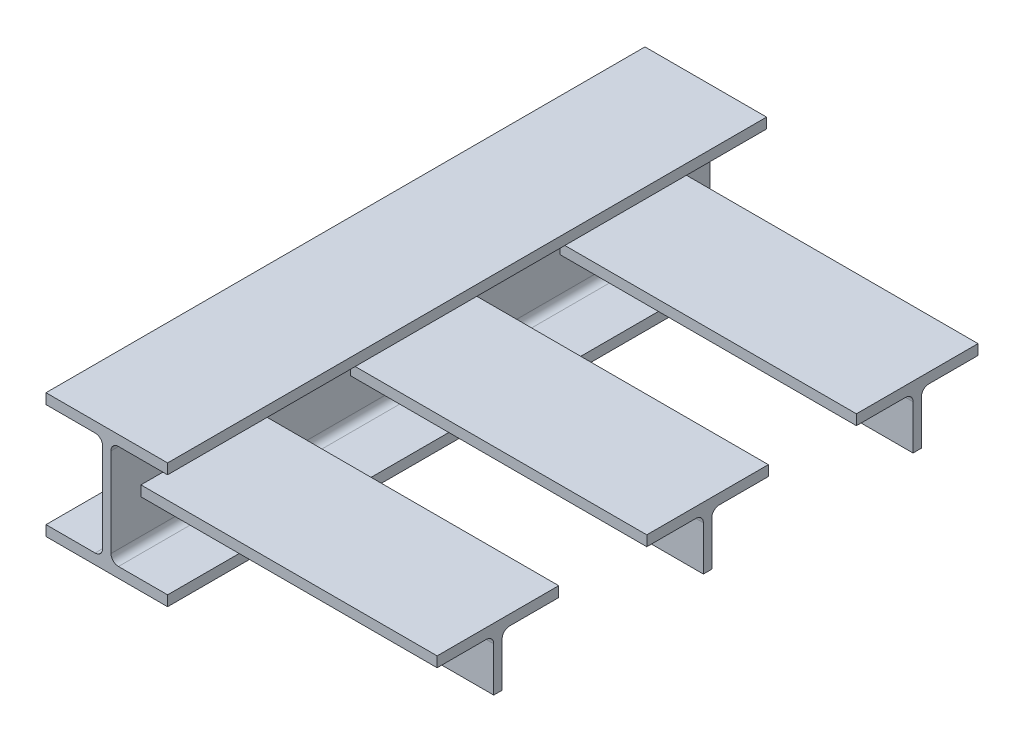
ISO-10303-21;
HEADER;
FILE_DESCRIPTION(('STEP AP214'),'2;1');
FILE_NAME('part.step','',(''),(''),'','','');
FILE_SCHEMA(('AUTOMOTIVE_DESIGN { 1 0 10303 214 1 1 1 1 }'));
ENDSEC;
DATA;
#1=APPLICATION_CONTEXT('core data for automotive mechanical design processes');
#2=APPLICATION_PROTOCOL_DEFINITION('international standard','automotive_design',2000,#1);
#3=PRODUCT_CONTEXT('',#1,'mechanical');
#4=PRODUCT('Part','Part','',(#3));
#5=PRODUCT_RELATED_PRODUCT_CATEGORY('part','',(#4));
#6=PRODUCT_DEFINITION_FORMATION('','',#4);
#7=PRODUCT_DEFINITION_CONTEXT('part definition',#1,'design');
#8=PRODUCT_DEFINITION('design','',#6,#7);
#9=PRODUCT_DEFINITION_SHAPE('','',#8);
#10=(LENGTH_UNIT() NAMED_UNIT(*) SI_UNIT(.MILLI.,.METRE.));
#11=(NAMED_UNIT(*) PLANE_ANGLE_UNIT() SI_UNIT($,.RADIAN.));
#12=(NAMED_UNIT(*) SI_UNIT($,.STERADIAN.) SOLID_ANGLE_UNIT());
#13=UNCERTAINTY_MEASURE_WITH_UNIT(LENGTH_MEASURE(1.E-05),#10,'distance_accuracy_value','');
#14=(GEOMETRIC_REPRESENTATION_CONTEXT(3) GLOBAL_UNCERTAINTY_ASSIGNED_CONTEXT((#13)) GLOBAL_UNIT_ASSIGNED_CONTEXT((#10,
#11,#12)) REPRESENTATION_CONTEXT('',''));
#15=CARTESIAN_POINT('',(0.,0.,0.));
#16=DIRECTION('',(0.,0.,1.));
#17=DIRECTION('',(1.,0.,0.));
#18=AXIS2_PLACEMENT_3D('',#15,#16,#17);
#19=CARTESIAN_POINT('',(103.12391068,8.76299240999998,-609.6));
#20=DIRECTION('',(1.,0.,0.));
#21=DIRECTION('',(0.,0.,-1.));
#22=AXIS2_PLACEMENT_3D('',#19,#20,#21);
#23=PLANE('',#22);
#24=DIRECTION('',(0.,1.,0.));
#25=VECTOR('',#24,1.);
#26=CARTESIAN_POINT('',(103.123910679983,0.,-175.00595842));
#27=LINE('',#26,#25);
#28=CARTESIAN_POINT('',(103.123910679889,0.,-175.00595842));
#29=VERTEX_POINT('',#28);
#30=CARTESIAN_POINT('',(103.123910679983,8.76299240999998,-175.00595842));
#31=VERTEX_POINT('',#30);
#32=EDGE_CURVE('E175',#29,#31,#27,.T.);
#33=ORIENTED_EDGE('',*,*,#32,.T.);
#34=DIRECTION('',(0.,0.,1.));
#35=VECTOR('',#34,1.);
#36=CARTESIAN_POINT('',(103.12391068,8.76299240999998,-609.6));
#37=LINE('',#36,#35);
#38=CARTESIAN_POINT('',(103.123910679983,8.76299240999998,-182.11795226));
#39=VERTEX_POINT('',#38);
#40=EDGE_CURVE('E43',#39,#31,#37,.T.);
#41=ORIENTED_EDGE('',*,*,#40,.F.);
#42=DIRECTION('',(0.,-1.,0.));
#43=VECTOR('',#42,1.);
#44=CARTESIAN_POINT('',(103.123910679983,37.71901309,-182.11795226));
#45=LINE('',#44,#43);
#46=CARTESIAN_POINT('',(103.123910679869,0.,-182.11795226));
#47=VERTEX_POINT('',#46);
#48=EDGE_CURVE('E188',#39,#47,#45,.T.);
#49=ORIENTED_EDGE('',*,*,#48,.T.);
#50=DIRECTION('',(0.,0.,1.));
#51=VECTOR('',#50,1.);
#52=CARTESIAN_POINT('',(103.12391068,0.,-609.6));
#53=LINE('',#52,#51);
#54=EDGE_CURVE('E177',#47,#29,#53,.T.);
#55=ORIENTED_EDGE('',*,*,#54,.T.);
#56=EDGE_LOOP('',(#33,#41,#49,#55));
#57=FACE_BOUND('',#56,.T.);
#58=ADVANCED_FACE('F39',(#57),#23,.F.);
#59=CARTESIAN_POINT('',(61.46794676,8.76299240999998,-609.6));
#60=DIRECTION('',(0.,1.,0.));
#61=DIRECTION('',(-1.,0.,0.));
#62=AXIS2_PLACEMENT_3D('',#59,#60,#61);
#63=PLANE('',#62);
#64=DIRECTION('',(-1.,0.,0.));
#65=VECTOR('',#64,1.);
#66=CARTESIAN_POINT('',(-500000.,8.76299240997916,-175.00595842));
#67=LINE('',#66,#65);
#68=CARTESIAN_POINT('',(61.4679467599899,8.76299240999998,-175.00595842));
#69=VERTEX_POINT('',#68);
#70=EDGE_CURVE('E173',#31,#69,#67,.T.);
#71=ORIENTED_EDGE('',*,*,#70,.T.);
#72=DIRECTION('',(0.,0.,1.));
#73=VECTOR('',#72,1.);
#74=CARTESIAN_POINT('',(61.46794676,8.76299240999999,-609.6));
#75=LINE('',#74,#73);
#76=CARTESIAN_POINT('',(61.4679467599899,8.76299240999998,-182.11795226));
#77=VERTEX_POINT('',#76);
#78=EDGE_CURVE('E204',#77,#69,#75,.T.);
#79=ORIENTED_EDGE('',*,*,#78,.F.);
#80=DIRECTION('',(1.,0.,0.));
#81=VECTOR('',#80,1.);
#82=CARTESIAN_POINT('',(-500000.,8.76299240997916,-182.11795226));
#83=LINE('',#82,#81);
#84=EDGE_CURVE('E185',#77,#39,#83,.T.);
#85=ORIENTED_EDGE('',*,*,#84,.T.);
#86=ORIENTED_EDGE('',*,*,#40,.T.);
#87=EDGE_LOOP('',(#71,#79,#85,#86));
#88=FACE_BOUND('',#87,.T.);
#89=ADVANCED_FACE('F213',(#88),#63,.F.);
#90=CARTESIAN_POINT('',(61.46794676,15.11298691,-609.6));
#91=DIRECTION('',(0.,0.,1.));
#92=DIRECTION('',(1.,0.,0.));
#93=AXIS2_PLACEMENT_3D('',#90,#91,#92);
#94=CYLINDRICAL_SURFACE('',#93,6.3499945);
#95=CARTESIAN_POINT('',(61.46794676,15.11298691,-175.00595842));
#96=DIRECTION('',(0.,0.,1.));
#97=DIRECTION('',(1.,0.,0.));
#98=AXIS2_PLACEMENT_3D('',#95,#96,#97);
#99=CIRCLE('',#98,6.3499945);
#100=CARTESIAN_POINT('',(55.11795226,15.11298691,-175.00595842));
#101=VERTEX_POINT('',#100);
#102=EDGE_CURVE('E171',#69,#101,#99,.F.);
#103=ORIENTED_EDGE('',*,*,#102,.T.);
#104=DIRECTION('',(0.,0.,1.));
#105=VECTOR('',#104,1.);
#106=CARTESIAN_POINT('',(55.11795226,15.11298691,-609.6));
#107=LINE('',#106,#105);
#108=CARTESIAN_POINT('',(55.11795226,15.11298691,-182.11795226));
#109=VERTEX_POINT('',#108);
#110=EDGE_CURVE('E158',#109,#101,#107,.T.);
#111=ORIENTED_EDGE('',*,*,#110,.F.);
#112=CARTESIAN_POINT('',(61.46794676,15.11298691,-182.11795226));
#113=DIRECTION('',(0.,0.,-1.));
#114=DIRECTION('',(0.,1.,0.));
#115=AXIS2_PLACEMENT_3D('',#112,#113,#114);
#116=CIRCLE('',#115,6.3499945);
#117=EDGE_CURVE('E182',#109,#77,#116,.F.);
#118=ORIENTED_EDGE('',*,*,#117,.T.);
#119=ORIENTED_EDGE('',*,*,#78,.T.);
#120=EDGE_LOOP('',(#103,#111,#118,#119));
#121=FACE_BOUND('',#120,.T.);
#122=ADVANCED_FACE('F217',(#121),#94,.T.);
#123=CARTESIAN_POINT('',(55.11795226,90.55092157,-609.6));
#124=DIRECTION('',(1.,0.,0.));
#125=DIRECTION('',(0.,0.,-1.));
#126=AXIS2_PLACEMENT_3D('',#123,#124,#125);
#127=PLANE('',#126);
#128=DIRECTION('',(0.,1.,0.));
#129=VECTOR('',#128,1.);
#130=CARTESIAN_POINT('',(55.1179522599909,0.,-175.00595842));
#131=LINE('',#130,#129);
#132=CARTESIAN_POINT('',(55.1179522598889,37.71901309,-175.00595842));
#133=VERTEX_POINT('',#132);
#134=EDGE_CURVE('E155',#101,#133,#131,.T.);
#135=ORIENTED_EDGE('',*,*,#134,.T.);
#136=CARTESIAN_POINT('',(55.11795226,37.71901309,-168.65596392));
#137=DIRECTION('',(1.,0.,0.));
#138=DIRECTION('',(0.,0.,-1.));
#139=AXIS2_PLACEMENT_3D('',#136,#137,#138);
#140=CIRCLE('',#139,6.3499945);
#141=CARTESIAN_POINT('',(55.1179522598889,44.06900759,-168.65596392));
#142=VERTEX_POINT('',#141);
#143=EDGE_CURVE('E149',#133,#142,#140,.T.);
#144=ORIENTED_EDGE('',*,*,#143,.T.);
#145=DIRECTION('',(0.,0.,1.));
#146=VECTOR('',#145,1.);
#147=CARTESIAN_POINT('',(55.1179522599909,44.06900759,-168.65596392));
#148=LINE('',#147,#146);
#149=CARTESIAN_POINT('',(55.1179522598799,44.06900759,-127.));
#150=VERTEX_POINT('',#149);
#151=EDGE_CURVE('E138',#142,#150,#148,.T.);
#152=ORIENTED_EDGE('',*,*,#151,.T.);
#153=DIRECTION('',(0.,1.,0.));
#154=VECTOR('',#153,1.);
#155=CARTESIAN_POINT('',(55.1179522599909,44.06900759,-127.));
#156=LINE('',#155,#154);
#157=CARTESIAN_POINT('',(55.1179522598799,52.832,-127.));
#158=VERTEX_POINT('',#157);
#159=EDGE_CURVE('E148',#150,#158,#156,.T.);
#160=ORIENTED_EDGE('',*,*,#159,.T.);
#161=DIRECTION('',(0.,0.,-1.));
#162=VECTOR('',#161,1.);
#163=CARTESIAN_POINT('',(55.1179522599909,52.832,-127.));
#164=LINE('',#163,#162);
#165=CARTESIAN_POINT('',(55.1179522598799,52.832,-230.12391068));
#166=VERTEX_POINT('',#165);
#167=EDGE_CURVE('E200',#158,#166,#164,.T.);
#168=ORIENTED_EDGE('',*,*,#167,.T.);
#169=DIRECTION('',(0.,-1.,0.));
#170=VECTOR('',#169,1.);
#171=CARTESIAN_POINT('',(55.1179522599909,52.832,-230.12391068));
#172=LINE('',#171,#170);
#173=CARTESIAN_POINT('',(55.1179522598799,44.06900759,-230.12391068));
#174=VERTEX_POINT('',#173);
#175=EDGE_CURVE('E197',#166,#174,#172,.T.);
#176=ORIENTED_EDGE('',*,*,#175,.T.);
#177=DIRECTION('',(0.,0.,1.));
#178=VECTOR('',#177,1.);
#179=CARTESIAN_POINT('',(55.1179522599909,44.06900759,-230.12391068));
#180=LINE('',#179,#178);
#181=CARTESIAN_POINT('',(55.1179522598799,44.06900759,-188.46794676));
#182=VERTEX_POINT('',#181);
#183=EDGE_CURVE('E194',#174,#182,#180,.T.);
#184=ORIENTED_EDGE('',*,*,#183,.T.);
#185=CARTESIAN_POINT('',(55.11795226,37.71901309,-188.46794676));
#186=DIRECTION('',(1.,0.,0.));
#187=DIRECTION('',(0.,0.,-1.));
#188=AXIS2_PLACEMENT_3D('',#185,#186,#187);
#189=CIRCLE('',#188,6.34999449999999);
#190=CARTESIAN_POINT('',(55.1179522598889,37.71901309,-182.11795226));
#191=VERTEX_POINT('',#190);
#192=EDGE_CURVE('E191',#182,#191,#189,.T.);
#193=ORIENTED_EDGE('',*,*,#192,.T.);
#194=DIRECTION('',(0.,-1.,0.));
#195=VECTOR('',#194,1.);
#196=CARTESIAN_POINT('',(55.1179522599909,37.71901309,-182.11795226));
#197=LINE('',#196,#195);
#198=EDGE_CURVE('E179',#191,#109,#197,.T.);
#199=ORIENTED_EDGE('',*,*,#198,.T.);
#200=ORIENTED_EDGE('',*,*,#110,.T.);
#201=EDGE_LOOP('',(#135,#144,#152,#160,#168,#176,#184,#193,#199,#200));
#202=FACE_BOUND('',#201,.T.);
#203=ADVANCED_FACE('F152',(#202),#127,.F.);
#204=CARTESIAN_POINT('',(-500000.,0.,-175.00595842));
#205=DIRECTION('',(0.,-1.,0.));
#206=DIRECTION('',(0.,0.,-1.));
#207=AXIS2_PLACEMENT_3D('',#204,#205,#206);
#208=PLANE('',#207);
#209=ORIENTED_EDGE('',*,*,#54,.F.);
#210=DIRECTION('',(1.,0.,0.));
#211=VECTOR('',#210,1.);
#212=CARTESIAN_POINT('',(-500000.,0.,-182.11795226));
#213=LINE('',#212,#211);
#214=CARTESIAN_POINT('',(306.32391068,0.,-182.11795226));
#215=VERTEX_POINT('',#214);
#216=EDGE_CURVE('E63',#47,#215,#213,.T.);
#217=ORIENTED_EDGE('',*,*,#216,.T.);
#218=DIRECTION('',(0.,0.,-1.));
#219=VECTOR('',#218,1.);
#220=CARTESIAN_POINT('',(306.32391068,0.,-175.00595842));
#221=LINE('',#220,#219);
#222=CARTESIAN_POINT('',(306.32391068,0.,-175.00595842));
#223=VERTEX_POINT('',#222);
#224=EDGE_CURVE('E164',#223,#215,#221,.T.);
#225=ORIENTED_EDGE('',*,*,#224,.F.);
#226=DIRECTION('',(1.,0.,0.));
#227=VECTOR('',#226,1.);
#228=CARTESIAN_POINT('',(-500000.,0.,-175.00595842));
#229=LINE('',#228,#227);
#230=EDGE_CURVE('E56',#29,#223,#229,.T.);
#231=ORIENTED_EDGE('',*,*,#230,.F.);
#232=EDGE_LOOP('',(#209,#217,#225,#231));
#233=FACE_BOUND('',#232,.T.);
#234=ADVANCED_FACE('F223',(#233),#208,.T.);
#235=CARTESIAN_POINT('',(-500000.,37.71901309,-182.11795226));
#236=DIRECTION('',(0.,0.,-1.));
#237=DIRECTION('',(0.,1.,0.));
#238=AXIS2_PLACEMENT_3D('',#235,#236,#237);
#239=PLANE('',#238);
#240=ORIENTED_EDGE('',*,*,#198,.F.);
#241=DIRECTION('',(1.,0.,0.));
#242=VECTOR('',#241,1.);
#243=CARTESIAN_POINT('',(-500000.,37.71901309,-182.11795226));
#244=LINE('',#243,#242);
#245=CARTESIAN_POINT('',(306.32391068,37.71901309,-182.11795226));
#246=VERTEX_POINT('',#245);
#247=EDGE_CURVE('E221',#191,#246,#244,.T.);
#248=ORIENTED_EDGE('',*,*,#247,.T.);
#249=DIRECTION('',(0.,1.,0.));
#250=VECTOR('',#249,1.);
#251=CARTESIAN_POINT('',(306.32391068,37.71901309,-182.11795226));
#252=LINE('',#251,#250);
#253=EDGE_CURVE('E264',#215,#246,#252,.T.);
#254=ORIENTED_EDGE('',*,*,#253,.F.);
#255=ORIENTED_EDGE('',*,*,#216,.F.);
#256=ORIENTED_EDGE('',*,*,#48,.F.);
#257=ORIENTED_EDGE('',*,*,#84,.F.);
#258=ORIENTED_EDGE('',*,*,#117,.F.);
#259=EDGE_LOOP('',(#240,#248,#254,#255,#256,#257,#258));
#260=FACE_BOUND('',#259,.T.);
#261=ADVANCED_FACE('F220',(#260),#239,.T.);
#262=CARTESIAN_POINT('',(-500000.,37.71901309,-188.46794676));
#263=DIRECTION('',(1.,0.,0.));
#264=DIRECTION('',(0.,0.,-1.));
#265=AXIS2_PLACEMENT_3D('',#262,#263,#264);
#266=CYLINDRICAL_SURFACE('',#265,6.34999449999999);
#267=ORIENTED_EDGE('',*,*,#192,.F.);
#268=DIRECTION('',(1.,0.,0.));
#269=VECTOR('',#268,1.);
#270=CARTESIAN_POINT('',(-500000.,44.06900759,-188.46794676));
#271=LINE('',#270,#269);
#272=CARTESIAN_POINT('',(306.32391068,44.06900759,-188.46794676));
#273=VERTEX_POINT('',#272);
#274=EDGE_CURVE('E231',#182,#273,#271,.T.);
#275=ORIENTED_EDGE('',*,*,#274,.T.);
#276=CARTESIAN_POINT('',(306.32391068,37.71901309,-188.46794676));
#277=DIRECTION('',(-1.,0.,0.));
#278=DIRECTION('',(0.,0.,-1.));
#279=AXIS2_PLACEMENT_3D('',#276,#277,#278);
#280=CIRCLE('',#279,6.34999449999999);
#281=EDGE_CURVE('E262',#246,#273,#280,.T.);
#282=ORIENTED_EDGE('',*,*,#281,.F.);
#283=ORIENTED_EDGE('',*,*,#247,.F.);
#284=EDGE_LOOP('',(#267,#275,#282,#283));
#285=FACE_BOUND('',#284,.T.);
#286=ADVANCED_FACE('F269',(#285),#266,.F.);
#287=CARTESIAN_POINT('',(-500000.,44.06900759,-230.12391068));
#288=DIRECTION('',(0.,-1.,0.));
#289=DIRECTION('',(0.,0.,-1.));
#290=AXIS2_PLACEMENT_3D('',#287,#288,#289);
#291=PLANE('',#290);
#292=ORIENTED_EDGE('',*,*,#183,.F.);
#293=DIRECTION('',(1.,0.,0.));
#294=VECTOR('',#293,1.);
#295=CARTESIAN_POINT('',(-500000.,44.06900759,-230.12391068));
#296=LINE('',#295,#294);
#297=CARTESIAN_POINT('',(306.32391068,44.06900759,-230.12391068));
#298=VERTEX_POINT('',#297);
#299=EDGE_CURVE('E233',#174,#298,#296,.T.);
#300=ORIENTED_EDGE('',*,*,#299,.T.);
#301=DIRECTION('',(0.,0.,-1.));
#302=VECTOR('',#301,1.);
#303=CARTESIAN_POINT('',(306.32391068,44.06900759,-230.12391068));
#304=LINE('',#303,#302);
#305=EDGE_CURVE('E257',#273,#298,#304,.T.);
#306=ORIENTED_EDGE('',*,*,#305,.F.);
#307=ORIENTED_EDGE('',*,*,#274,.F.);
#308=EDGE_LOOP('',(#292,#300,#306,#307));
#309=FACE_BOUND('',#308,.T.);
#310=ADVANCED_FACE('F272',(#309),#291,.T.);
#311=CARTESIAN_POINT('',(-500000.,52.832,-230.12391068));
#312=DIRECTION('',(0.,0.,-1.));
#313=DIRECTION('',(-1.,0.,0.));
#314=AXIS2_PLACEMENT_3D('',#311,#312,#313);
#315=PLANE('',#314);
#316=ORIENTED_EDGE('',*,*,#175,.F.);
#317=DIRECTION('',(1.,0.,0.));
#318=VECTOR('',#317,1.);
#319=CARTESIAN_POINT('',(-500000.,52.832,-230.12391068));
#320=LINE('',#319,#318);
#321=CARTESIAN_POINT('',(306.32391068,52.832,-230.12391068));
#322=VERTEX_POINT('',#321);
#323=EDGE_CURVE('E235',#166,#322,#320,.T.);
#324=ORIENTED_EDGE('',*,*,#323,.T.);
#325=DIRECTION('',(0.,1.,0.));
#326=VECTOR('',#325,1.);
#327=CARTESIAN_POINT('',(306.32391068,52.832,-230.12391068));
#328=LINE('',#327,#326);
#329=EDGE_CURVE('E255',#298,#322,#328,.T.);
#330=ORIENTED_EDGE('',*,*,#329,.F.);
#331=ORIENTED_EDGE('',*,*,#299,.F.);
#332=EDGE_LOOP('',(#316,#324,#330,#331));
#333=FACE_BOUND('',#332,.T.);
#334=ADVANCED_FACE('F275',(#333),#315,.T.);
#335=CARTESIAN_POINT('',(-500000.,52.832,-127.));
#336=DIRECTION('',(0.,1.,0.));
#337=DIRECTION('',(0.,0.,1.));
#338=AXIS2_PLACEMENT_3D('',#335,#336,#337);
#339=PLANE('',#338);
#340=ORIENTED_EDGE('',*,*,#167,.F.);
#341=DIRECTION('',(1.,0.,0.));
#342=VECTOR('',#341,1.);
#343=CARTESIAN_POINT('',(-500000.,52.832,-127.));
#344=LINE('',#343,#342);
#345=CARTESIAN_POINT('',(306.32391068,52.832,-127.));
#346=VERTEX_POINT('',#345);
#347=EDGE_CURVE('E166',#158,#346,#344,.T.);
#348=ORIENTED_EDGE('',*,*,#347,.T.);
#349=DIRECTION('',(0.,0.,1.));
#350=VECTOR('',#349,1.);
#351=CARTESIAN_POINT('',(306.32391068,52.832,-127.));
#352=LINE('',#351,#350);
#353=EDGE_CURVE('E243',#322,#346,#352,.T.);
#354=ORIENTED_EDGE('',*,*,#353,.F.);
#355=ORIENTED_EDGE('',*,*,#323,.F.);
#356=EDGE_LOOP('',(#340,#348,#354,#355));
#357=FACE_BOUND('',#356,.T.);
#358=ADVANCED_FACE('F240',(#357),#339,.T.);
#359=CARTESIAN_POINT('',(-500000.,44.06900759,-127.));
#360=DIRECTION('',(0.,0.,1.));
#361=DIRECTION('',(1.,0.,0.));
#362=AXIS2_PLACEMENT_3D('',#359,#360,#361);
#363=PLANE('',#362);
#364=ORIENTED_EDGE('',*,*,#159,.F.);
#365=DIRECTION('',(1.,0.,0.));
#366=VECTOR('',#365,1.);
#367=CARTESIAN_POINT('',(-500000.,44.06900759,-127.));
#368=LINE('',#367,#366);
#369=CARTESIAN_POINT('',(306.32391068,44.06900759,-127.));
#370=VERTEX_POINT('',#369);
#371=EDGE_CURVE('E145',#150,#370,#368,.T.);
#372=ORIENTED_EDGE('',*,*,#371,.T.);
#373=DIRECTION('',(0.,-1.,0.));
#374=VECTOR('',#373,1.);
#375=CARTESIAN_POINT('',(306.32391068,44.06900759,-127.));
#376=LINE('',#375,#374);
#377=EDGE_CURVE('E247',#346,#370,#376,.T.);
#378=ORIENTED_EDGE('',*,*,#377,.F.);
#379=ORIENTED_EDGE('',*,*,#347,.F.);
#380=EDGE_LOOP('',(#364,#372,#378,#379));
#381=FACE_BOUND('',#380,.T.);
#382=ADVANCED_FACE('F248',(#381),#363,.T.);
#383=CARTESIAN_POINT('',(-500000.,44.06900759,-168.65596392));
#384=DIRECTION('',(0.,-1.,0.));
#385=DIRECTION('',(0.,0.,-1.));
#386=AXIS2_PLACEMENT_3D('',#383,#384,#385);
#387=PLANE('',#386);
#388=ORIENTED_EDGE('',*,*,#151,.F.);
#389=DIRECTION('',(1.,0.,0.));
#390=VECTOR('',#389,1.);
#391=CARTESIAN_POINT('',(-500000.,44.06900759,-168.65596392));
#392=LINE('',#391,#390);
#393=CARTESIAN_POINT('',(306.32391068,44.06900759,-168.65596392));
#394=VERTEX_POINT('',#393);
#395=EDGE_CURVE('E143',#142,#394,#392,.T.);
#396=ORIENTED_EDGE('',*,*,#395,.T.);
#397=DIRECTION('',(0.,0.,-1.));
#398=VECTOR('',#397,1.);
#399=CARTESIAN_POINT('',(306.32391068,44.06900759,-168.65596392));
#400=LINE('',#399,#398);
#401=EDGE_CURVE('E250',#370,#394,#400,.T.);
#402=ORIENTED_EDGE('',*,*,#401,.F.);
#403=ORIENTED_EDGE('',*,*,#371,.F.);
#404=EDGE_LOOP('',(#388,#396,#402,#403));
#405=FACE_BOUND('',#404,.T.);
#406=ADVANCED_FACE('F140',(#405),#387,.T.);
#407=CARTESIAN_POINT('',(306.32391068,37.71901309,-168.65596392));
#408=DIRECTION('',(1.,0.,0.));
#409=DIRECTION('',(0.,0.,-1.));
#410=AXIS2_PLACEMENT_3D('',#407,#408,#409);
#411=PLANE('',#410);
#412=DIRECTION('',(0.,-1.,0.));
#413=VECTOR('',#412,1.);
#414=CARTESIAN_POINT('',(306.32391068,0.,-175.00595842));
#415=LINE('',#414,#413);
#416=CARTESIAN_POINT('',(306.32391068,37.71901309,-175.00595842));
#417=VERTEX_POINT('',#416);
#418=EDGE_CURVE('E12',#417,#223,#415,.T.);
#419=ORIENTED_EDGE('',*,*,#418,.T.);
#420=ORIENTED_EDGE('',*,*,#224,.T.);
#421=ORIENTED_EDGE('',*,*,#253,.T.);
#422=ORIENTED_EDGE('',*,*,#281,.T.);
#423=ORIENTED_EDGE('',*,*,#305,.T.);
#424=ORIENTED_EDGE('',*,*,#329,.T.);
#425=ORIENTED_EDGE('',*,*,#353,.T.);
#426=ORIENTED_EDGE('',*,*,#377,.T.);
#427=ORIENTED_EDGE('',*,*,#401,.T.);
#428=CARTESIAN_POINT('',(306.32391068,37.71901309,-168.65596392));
#429=DIRECTION('',(-1.,0.,0.));
#430=DIRECTION('',(0.,0.,-1.));
#431=AXIS2_PLACEMENT_3D('',#428,#429,#430);
#432=CIRCLE('',#431,6.3499945);
#433=EDGE_CURVE('E48',#394,#417,#432,.T.);
#434=ORIENTED_EDGE('',*,*,#433,.T.);
#435=EDGE_LOOP('',(#419,#420,#421,#422,#423,#424,#425,#426,#427,#434));
#436=FACE_BOUND('',#435,.T.);
#437=ADVANCED_FACE('F252',(#436),#411,.T.);
#438=CARTESIAN_POINT('',(-500000.,0.,-175.00595842));
#439=DIRECTION('',(0.,0.,1.));
#440=DIRECTION('',(1.,0.,0.));
#441=AXIS2_PLACEMENT_3D('',#438,#439,#440);
#442=PLANE('',#441);
#443=ORIENTED_EDGE('',*,*,#134,.F.);
#444=ORIENTED_EDGE('',*,*,#102,.F.);
#445=ORIENTED_EDGE('',*,*,#70,.F.);
#446=ORIENTED_EDGE('',*,*,#32,.F.);
#447=ORIENTED_EDGE('',*,*,#230,.T.);
#448=ORIENTED_EDGE('',*,*,#418,.F.);
#449=DIRECTION('',(1.,0.,0.));
#450=VECTOR('',#449,1.);
#451=CARTESIAN_POINT('',(-500000.,37.71901309,-175.00595842));
#452=LINE('',#451,#450);
#453=EDGE_CURVE('E162',#133,#417,#452,.T.);
#454=ORIENTED_EDGE('',*,*,#453,.F.);
#455=EDGE_LOOP('',(#443,#444,#445,#446,#447,#448,#454));
#456=FACE_BOUND('',#455,.T.);
#457=ADVANCED_FACE('F215',(#456),#442,.T.);
#458=CARTESIAN_POINT('',(-500000.,37.71901309,-168.65596392));
#459=DIRECTION('',(1.,0.,0.));
#460=DIRECTION('',(0.,0.,-1.));
#461=AXIS2_PLACEMENT_3D('',#458,#459,#460);
#462=CYLINDRICAL_SURFACE('',#461,6.3499945);
#463=ORIENTED_EDGE('',*,*,#143,.F.);
#464=ORIENTED_EDGE('',*,*,#453,.T.);
#465=ORIENTED_EDGE('',*,*,#433,.F.);
#466=ORIENTED_EDGE('',*,*,#395,.F.);
#467=EDGE_LOOP('',(#463,#464,#465,#466));
#468=FACE_BOUND('',#467,.T.);
#469=ADVANCED_FACE('F41',(#468),#462,.F.);
#470=CLOSED_SHELL('',(#58,#89,#122,#203,#234,#261,#286,#310,#334,#358,#382,#406,#437,#457,#469));
#471=MANIFOLD_SOLID_BREP('B2',#470);
#472=CARTESIAN_POINT('',(103.12391068,8.76299240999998,-431.8));
#473=DIRECTION('',(1.,0.,0.));
#474=DIRECTION('',(0.,0.,-1.));
#475=AXIS2_PLACEMENT_3D('',#472,#473,#474);
#476=PLANE('',#475);
#477=DIRECTION('',(0.,1.,0.));
#478=VECTOR('',#477,1.);
#479=CARTESIAN_POINT('',(103.123910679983,0.,2.79404157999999));
#480=LINE('',#479,#478);
#481=CARTESIAN_POINT('',(103.123910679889,0.,2.79404157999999));
#482=VERTEX_POINT('',#481);
#483=CARTESIAN_POINT('',(103.123910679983,8.76299240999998,2.79404157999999));
#484=VERTEX_POINT('',#483);
#485=EDGE_CURVE('E512',#482,#484,#480,.T.);
#486=ORIENTED_EDGE('',*,*,#485,.T.);
#487=DIRECTION('',(0.,0.,1.));
#488=VECTOR('',#487,1.);
#489=CARTESIAN_POINT('',(103.12391068,8.76299240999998,-431.8));
#490=LINE('',#489,#488);
#491=CARTESIAN_POINT('',(103.123910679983,8.76299240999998,-4.31795226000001));
#492=VERTEX_POINT('',#491);
#493=EDGE_CURVE('E380',#492,#484,#490,.T.);
#494=ORIENTED_EDGE('',*,*,#493,.F.);
#495=DIRECTION('',(0.,-1.,0.));
#496=VECTOR('',#495,1.);
#497=CARTESIAN_POINT('',(103.123910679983,37.71901309,-4.31795225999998));
#498=LINE('',#497,#496);
#499=CARTESIAN_POINT('',(103.123910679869,0.,-4.31795226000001));
#500=VERTEX_POINT('',#499);
#501=EDGE_CURVE('E525',#492,#500,#498,.T.);
#502=ORIENTED_EDGE('',*,*,#501,.T.);
#503=DIRECTION('',(0.,0.,1.));
#504=VECTOR('',#503,1.);
#505=CARTESIAN_POINT('',(103.12391068,0.,-431.8));
#506=LINE('',#505,#504);
#507=EDGE_CURVE('E514',#500,#482,#506,.T.);
#508=ORIENTED_EDGE('',*,*,#507,.T.);
#509=EDGE_LOOP('',(#486,#494,#502,#508));
#510=FACE_BOUND('',#509,.T.);
#511=ADVANCED_FACE('F376',(#510),#476,.F.);
#512=CARTESIAN_POINT('',(61.46794676,8.76299240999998,-431.8));
#513=DIRECTION('',(0.,1.,0.));
#514=DIRECTION('',(-1.,0.,0.));
#515=AXIS2_PLACEMENT_3D('',#512,#513,#514);
#516=PLANE('',#515);
#517=DIRECTION('',(-1.,0.,0.));
#518=VECTOR('',#517,1.);
#519=CARTESIAN_POINT('',(-500000.,8.76299240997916,2.79404157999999));
#520=LINE('',#519,#518);
#521=CARTESIAN_POINT('',(61.4679467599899,8.76299240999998,2.79404157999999));
#522=VERTEX_POINT('',#521);
#523=EDGE_CURVE('E510',#484,#522,#520,.T.);
#524=ORIENTED_EDGE('',*,*,#523,.T.);
#525=DIRECTION('',(0.,0.,1.));
#526=VECTOR('',#525,1.);
#527=CARTESIAN_POINT('',(61.46794676,8.76299240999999,-431.8));
#528=LINE('',#527,#526);
#529=CARTESIAN_POINT('',(61.4679467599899,8.76299240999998,-4.31795226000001));
#530=VERTEX_POINT('',#529);
#531=EDGE_CURVE('E541',#530,#522,#528,.T.);
#532=ORIENTED_EDGE('',*,*,#531,.F.);
#533=DIRECTION('',(1.,0.,0.));
#534=VECTOR('',#533,1.);
#535=CARTESIAN_POINT('',(-500000.,8.76299240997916,-4.31795226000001));
#536=LINE('',#535,#534);
#537=EDGE_CURVE('E522',#530,#492,#536,.T.);
#538=ORIENTED_EDGE('',*,*,#537,.T.);
#539=ORIENTED_EDGE('',*,*,#493,.T.);
#540=EDGE_LOOP('',(#524,#532,#538,#539));
#541=FACE_BOUND('',#540,.T.);
#542=ADVANCED_FACE('F550',(#541),#516,.F.);
#543=CARTESIAN_POINT('',(61.46794676,15.11298691,-431.8));
#544=DIRECTION('',(0.,0.,1.));
#545=DIRECTION('',(1.,0.,0.));
#546=AXIS2_PLACEMENT_3D('',#543,#544,#545);
#547=CYLINDRICAL_SURFACE('',#546,6.3499945);
#548=CARTESIAN_POINT('',(61.46794676,15.11298691,2.79404157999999));
#549=DIRECTION('',(0.,0.,1.));
#550=DIRECTION('',(1.,0.,0.));
#551=AXIS2_PLACEMENT_3D('',#548,#549,#550);
#552=CIRCLE('',#551,6.3499945);
#553=CARTESIAN_POINT('',(55.11795226,15.11298691,2.79404157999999));
#554=VERTEX_POINT('',#553);
#555=EDGE_CURVE('E508',#522,#554,#552,.F.);
#556=ORIENTED_EDGE('',*,*,#555,.T.);
#557=DIRECTION('',(0.,0.,1.));
#558=VECTOR('',#557,1.);
#559=CARTESIAN_POINT('',(55.11795226,15.11298691,-431.8));
#560=LINE('',#559,#558);
#561=CARTESIAN_POINT('',(55.11795226,15.11298691,-4.31795226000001));
#562=VERTEX_POINT('',#561);
#563=EDGE_CURVE('E495',#562,#554,#560,.T.);
#564=ORIENTED_EDGE('',*,*,#563,.F.);
#565=CARTESIAN_POINT('',(61.46794676,15.11298691,-4.31795226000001));
#566=DIRECTION('',(0.,0.,-1.));
#567=DIRECTION('',(0.,1.,0.));
#568=AXIS2_PLACEMENT_3D('',#565,#566,#567);
#569=CIRCLE('',#568,6.3499945);
#570=EDGE_CURVE('E519',#562,#530,#569,.F.);
#571=ORIENTED_EDGE('',*,*,#570,.T.);
#572=ORIENTED_EDGE('',*,*,#531,.T.);
#573=EDGE_LOOP('',(#556,#564,#571,#572));
#574=FACE_BOUND('',#573,.T.);
#575=ADVANCED_FACE('F554',(#574),#547,.T.);
#576=CARTESIAN_POINT('',(55.11795226,90.55092157,-431.8));
#577=DIRECTION('',(1.,0.,0.));
#578=DIRECTION('',(0.,0.,-1.));
#579=AXIS2_PLACEMENT_3D('',#576,#577,#578);
#580=PLANE('',#579);
#581=DIRECTION('',(0.,1.,0.));
#582=VECTOR('',#581,1.);
#583=CARTESIAN_POINT('',(55.1179522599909,0.,2.79404157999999));
#584=LINE('',#583,#582);
#585=CARTESIAN_POINT('',(55.1179522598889,37.71901309,2.79404157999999));
#586=VERTEX_POINT('',#585);
#587=EDGE_CURVE('E492',#554,#586,#584,.T.);
#588=ORIENTED_EDGE('',*,*,#587,.T.);
#589=CARTESIAN_POINT('',(55.11795226,37.71901309,9.14403608));
#590=DIRECTION('',(1.,0.,0.));
#591=DIRECTION('',(0.,0.,-1.));
#592=AXIS2_PLACEMENT_3D('',#589,#590,#591);
#593=CIRCLE('',#592,6.3499945);
#594=CARTESIAN_POINT('',(55.1179522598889,44.06900759,9.14403608));
#595=VERTEX_POINT('',#594);
#596=EDGE_CURVE('E486',#586,#595,#593,.T.);
#597=ORIENTED_EDGE('',*,*,#596,.T.);
#598=DIRECTION('',(0.,0.,1.));
#599=VECTOR('',#598,1.);
#600=CARTESIAN_POINT('',(55.1179522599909,44.06900759,9.14403608));
#601=LINE('',#600,#599);
#602=CARTESIAN_POINT('',(55.1179522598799,44.06900759,50.8));
#603=VERTEX_POINT('',#602);
#604=EDGE_CURVE('E475',#595,#603,#601,.T.);
#605=ORIENTED_EDGE('',*,*,#604,.T.);
#606=DIRECTION('',(0.,1.,0.));
#607=VECTOR('',#606,1.);
#608=CARTESIAN_POINT('',(55.1179522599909,44.06900759,50.8));
#609=LINE('',#608,#607);
#610=CARTESIAN_POINT('',(55.1179522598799,52.832,50.8));
#611=VERTEX_POINT('',#610);
#612=EDGE_CURVE('E485',#603,#611,#609,.T.);
#613=ORIENTED_EDGE('',*,*,#612,.T.);
#614=DIRECTION('',(0.,0.,-1.));
#615=VECTOR('',#614,1.);
#616=CARTESIAN_POINT('',(55.1179522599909,52.832,50.8));
#617=LINE('',#616,#615);
#618=CARTESIAN_POINT('',(55.1179522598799,52.832,-52.3239106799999));
#619=VERTEX_POINT('',#618);
#620=EDGE_CURVE('E537',#611,#619,#617,.T.);
#621=ORIENTED_EDGE('',*,*,#620,.T.);
#622=DIRECTION('',(0.,-1.,0.));
#623=VECTOR('',#622,1.);
#624=CARTESIAN_POINT('',(55.1179522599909,52.832,-52.3239106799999));
#625=LINE('',#624,#623);
#626=CARTESIAN_POINT('',(55.1179522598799,44.06900759,-52.3239106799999));
#627=VERTEX_POINT('',#626);
#628=EDGE_CURVE('E534',#619,#627,#625,.T.);
#629=ORIENTED_EDGE('',*,*,#628,.T.);
#630=DIRECTION('',(0.,0.,1.));
#631=VECTOR('',#630,1.);
#632=CARTESIAN_POINT('',(55.1179522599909,44.06900759,-52.3239106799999));
#633=LINE('',#632,#631);
#634=CARTESIAN_POINT('',(55.1179522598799,44.06900759,-10.66794676));
#635=VERTEX_POINT('',#634);
#636=EDGE_CURVE('E531',#627,#635,#633,.T.);
#637=ORIENTED_EDGE('',*,*,#636,.T.);
#638=CARTESIAN_POINT('',(55.11795226,37.71901309,-10.66794676));
#639=DIRECTION('',(1.,0.,0.));
#640=DIRECTION('',(0.,0.,-1.));
#641=AXIS2_PLACEMENT_3D('',#638,#639,#640);
#642=CIRCLE('',#641,6.34999449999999);
#643=CARTESIAN_POINT('',(55.1179522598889,37.71901309,-4.31795225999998));
#644=VERTEX_POINT('',#643);
#645=EDGE_CURVE('E528',#635,#644,#642,.T.);
#646=ORIENTED_EDGE('',*,*,#645,.T.);
#647=DIRECTION('',(0.,-1.,0.));
#648=VECTOR('',#647,1.);
#649=CARTESIAN_POINT('',(55.1179522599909,37.71901309,-4.31795225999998));
#650=LINE('',#649,#648);
#651=EDGE_CURVE('E516',#644,#562,#650,.T.);
#652=ORIENTED_EDGE('',*,*,#651,.T.);
#653=ORIENTED_EDGE('',*,*,#563,.T.);
#654=EDGE_LOOP('',(#588,#597,#605,#613,#621,#629,#637,#646,#652,#653));
#655=FACE_BOUND('',#654,.T.);
#656=ADVANCED_FACE('F489',(#655),#580,.F.);
#657=CARTESIAN_POINT('',(-500000.,0.,2.79404157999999));
#658=DIRECTION('',(0.,-1.,0.));
#659=DIRECTION('',(0.,0.,-1.));
#660=AXIS2_PLACEMENT_3D('',#657,#658,#659);
#661=PLANE('',#660);
#662=ORIENTED_EDGE('',*,*,#507,.F.);
#663=DIRECTION('',(1.,0.,0.));
#664=VECTOR('',#663,1.);
#665=CARTESIAN_POINT('',(-500000.,0.,-4.31795226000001));
#666=LINE('',#665,#664);
#667=CARTESIAN_POINT('',(306.32391068,0.,-4.31795226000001));
#668=VERTEX_POINT('',#667);
#669=EDGE_CURVE('E400',#500,#668,#666,.T.);
#670=ORIENTED_EDGE('',*,*,#669,.T.);
#671=DIRECTION('',(0.,0.,-1.));
#672=VECTOR('',#671,1.);
#673=CARTESIAN_POINT('',(306.32391068,0.,2.79404157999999));
#674=LINE('',#673,#672);
#675=CARTESIAN_POINT('',(306.32391068,0.,2.79404157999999));
#676=VERTEX_POINT('',#675);
#677=EDGE_CURVE('E501',#676,#668,#674,.T.);
#678=ORIENTED_EDGE('',*,*,#677,.F.);
#679=DIRECTION('',(1.,0.,0.));
#680=VECTOR('',#679,1.);
#681=CARTESIAN_POINT('',(-500000.,0.,2.79404157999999));
#682=LINE('',#681,#680);
#683=EDGE_CURVE('E393',#482,#676,#682,.T.);
#684=ORIENTED_EDGE('',*,*,#683,.F.);
#685=EDGE_LOOP('',(#662,#670,#678,#684));
#686=FACE_BOUND('',#685,.T.);
#687=ADVANCED_FACE('F560',(#686),#661,.T.);
#688=CARTESIAN_POINT('',(-500000.,37.71901309,-4.31795225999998));
#689=DIRECTION('',(0.,0.,-1.));
#690=DIRECTION('',(0.,1.,0.));
#691=AXIS2_PLACEMENT_3D('',#688,#689,#690);
#692=PLANE('',#691);
#693=ORIENTED_EDGE('',*,*,#651,.F.);
#694=DIRECTION('',(1.,0.,0.));
#695=VECTOR('',#694,1.);
#696=CARTESIAN_POINT('',(-500000.,37.71901309,-4.31795225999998));
#697=LINE('',#696,#695);
#698=CARTESIAN_POINT('',(306.32391068,37.71901309,-4.31795225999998));
#699=VERTEX_POINT('',#698);
#700=EDGE_CURVE('E558',#644,#699,#697,.T.);
#701=ORIENTED_EDGE('',*,*,#700,.T.);
#702=DIRECTION('',(0.,1.,0.));
#703=VECTOR('',#702,1.);
#704=CARTESIAN_POINT('',(306.32391068,37.71901309,-4.31795225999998));
#705=LINE('',#704,#703);
#706=EDGE_CURVE('E601',#668,#699,#705,.T.);
#707=ORIENTED_EDGE('',*,*,#706,.F.);
#708=ORIENTED_EDGE('',*,*,#669,.F.);
#709=ORIENTED_EDGE('',*,*,#501,.F.);
#710=ORIENTED_EDGE('',*,*,#537,.F.);
#711=ORIENTED_EDGE('',*,*,#570,.F.);
#712=EDGE_LOOP('',(#693,#701,#707,#708,#709,#710,#711));
#713=FACE_BOUND('',#712,.T.);
#714=ADVANCED_FACE('F557',(#713),#692,.T.);
#715=CARTESIAN_POINT('',(-500000.,37.71901309,-10.66794676));
#716=DIRECTION('',(1.,0.,0.));
#717=DIRECTION('',(0.,0.,-1.));
#718=AXIS2_PLACEMENT_3D('',#715,#716,#717);
#719=CYLINDRICAL_SURFACE('',#718,6.34999449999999);
#720=ORIENTED_EDGE('',*,*,#645,.F.);
#721=DIRECTION('',(1.,0.,0.));
#722=VECTOR('',#721,1.);
#723=CARTESIAN_POINT('',(-500000.,44.06900759,-10.66794676));
#724=LINE('',#723,#722);
#725=CARTESIAN_POINT('',(306.32391068,44.06900759,-10.66794676));
#726=VERTEX_POINT('',#725);
#727=EDGE_CURVE('E568',#635,#726,#724,.T.);
#728=ORIENTED_EDGE('',*,*,#727,.T.);
#729=CARTESIAN_POINT('',(306.32391068,37.71901309,-10.66794676));
#730=DIRECTION('',(-1.,0.,0.));
#731=DIRECTION('',(0.,0.,-1.));
#732=AXIS2_PLACEMENT_3D('',#729,#730,#731);
#733=CIRCLE('',#732,6.34999449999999);
#734=EDGE_CURVE('E599',#699,#726,#733,.T.);
#735=ORIENTED_EDGE('',*,*,#734,.F.);
#736=ORIENTED_EDGE('',*,*,#700,.F.);
#737=EDGE_LOOP('',(#720,#728,#735,#736));
#738=FACE_BOUND('',#737,.T.);
#739=ADVANCED_FACE('F606',(#738),#719,.F.);
#740=CARTESIAN_POINT('',(-500000.,44.06900759,-52.3239106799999));
#741=DIRECTION('',(0.,-1.,0.));
#742=DIRECTION('',(0.,0.,-1.));
#743=AXIS2_PLACEMENT_3D('',#740,#741,#742);
#744=PLANE('',#743);
#745=ORIENTED_EDGE('',*,*,#636,.F.);
#746=DIRECTION('',(1.,0.,0.));
#747=VECTOR('',#746,1.);
#748=CARTESIAN_POINT('',(-500000.,44.06900759,-52.3239106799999));
#749=LINE('',#748,#747);
#750=CARTESIAN_POINT('',(306.32391068,44.06900759,-52.3239106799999));
#751=VERTEX_POINT('',#750);
#752=EDGE_CURVE('E570',#627,#751,#749,.T.);
#753=ORIENTED_EDGE('',*,*,#752,.T.);
#754=DIRECTION('',(0.,0.,-1.));
#755=VECTOR('',#754,1.);
#756=CARTESIAN_POINT('',(306.32391068,44.06900759,-52.3239106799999));
#757=LINE('',#756,#755);
#758=EDGE_CURVE('E594',#726,#751,#757,.T.);
#759=ORIENTED_EDGE('',*,*,#758,.F.);
#760=ORIENTED_EDGE('',*,*,#727,.F.);
#761=EDGE_LOOP('',(#745,#753,#759,#760));
#762=FACE_BOUND('',#761,.T.);
#763=ADVANCED_FACE('F609',(#762),#744,.T.);
#764=CARTESIAN_POINT('',(-500000.,52.832,-52.3239106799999));
#765=DIRECTION('',(0.,0.,-1.));
#766=DIRECTION('',(-1.,0.,0.));
#767=AXIS2_PLACEMENT_3D('',#764,#765,#766);
#768=PLANE('',#767);
#769=ORIENTED_EDGE('',*,*,#628,.F.);
#770=DIRECTION('',(1.,0.,0.));
#771=VECTOR('',#770,1.);
#772=CARTESIAN_POINT('',(-500000.,52.832,-52.3239106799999));
#773=LINE('',#772,#771);
#774=CARTESIAN_POINT('',(306.32391068,52.832,-52.3239106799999));
#775=VERTEX_POINT('',#774);
#776=EDGE_CURVE('E572',#619,#775,#773,.T.);
#777=ORIENTED_EDGE('',*,*,#776,.T.);
#778=DIRECTION('',(0.,1.,0.));
#779=VECTOR('',#778,1.);
#780=CARTESIAN_POINT('',(306.32391068,52.832,-52.3239106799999));
#781=LINE('',#780,#779);
#782=EDGE_CURVE('E592',#751,#775,#781,.T.);
#783=ORIENTED_EDGE('',*,*,#782,.F.);
#784=ORIENTED_EDGE('',*,*,#752,.F.);
#785=EDGE_LOOP('',(#769,#777,#783,#784));
#786=FACE_BOUND('',#785,.T.);
#787=ADVANCED_FACE('F612',(#786),#768,.T.);
#788=CARTESIAN_POINT('',(-500000.,52.832,50.8));
#789=DIRECTION('',(0.,1.,0.));
#790=DIRECTION('',(0.,0.,1.));
#791=AXIS2_PLACEMENT_3D('',#788,#789,#790);
#792=PLANE('',#791);
#793=ORIENTED_EDGE('',*,*,#620,.F.);
#794=DIRECTION('',(1.,0.,0.));
#795=VECTOR('',#794,1.);
#796=CARTESIAN_POINT('',(-500000.,52.832,50.8));
#797=LINE('',#796,#795);
#798=CARTESIAN_POINT('',(306.32391068,52.832,50.8));
#799=VERTEX_POINT('',#798);
#800=EDGE_CURVE('E503',#611,#799,#797,.T.);
#801=ORIENTED_EDGE('',*,*,#800,.T.);
#802=DIRECTION('',(0.,0.,1.));
#803=VECTOR('',#802,1.);
#804=CARTESIAN_POINT('',(306.32391068,52.832,50.8));
#805=LINE('',#804,#803);
#806=EDGE_CURVE('E580',#775,#799,#805,.T.);
#807=ORIENTED_EDGE('',*,*,#806,.F.);
#808=ORIENTED_EDGE('',*,*,#776,.F.);
#809=EDGE_LOOP('',(#793,#801,#807,#808));
#810=FACE_BOUND('',#809,.T.);
#811=ADVANCED_FACE('F577',(#810),#792,.T.);
#812=CARTESIAN_POINT('',(-500000.,44.06900759,50.8));
#813=DIRECTION('',(0.,0.,1.));
#814=DIRECTION('',(1.,0.,0.));
#815=AXIS2_PLACEMENT_3D('',#812,#813,#814);
#816=PLANE('',#815);
#817=ORIENTED_EDGE('',*,*,#612,.F.);
#818=DIRECTION('',(1.,0.,0.));
#819=VECTOR('',#818,1.);
#820=CARTESIAN_POINT('',(-500000.,44.06900759,50.8));
#821=LINE('',#820,#819);
#822=CARTESIAN_POINT('',(306.32391068,44.06900759,50.8));
#823=VERTEX_POINT('',#822);
#824=EDGE_CURVE('E482',#603,#823,#821,.T.);
#825=ORIENTED_EDGE('',*,*,#824,.T.);
#826=DIRECTION('',(0.,-1.,0.));
#827=VECTOR('',#826,1.);
#828=CARTESIAN_POINT('',(306.32391068,44.06900759,50.8));
#829=LINE('',#828,#827);
#830=EDGE_CURVE('E584',#799,#823,#829,.T.);
#831=ORIENTED_EDGE('',*,*,#830,.F.);
#832=ORIENTED_EDGE('',*,*,#800,.F.);
#833=EDGE_LOOP('',(#817,#825,#831,#832));
#834=FACE_BOUND('',#833,.T.);
#835=ADVANCED_FACE('F585',(#834),#816,.T.);
#836=CARTESIAN_POINT('',(-500000.,44.06900759,9.14403608));
#837=DIRECTION('',(0.,-1.,0.));
#838=DIRECTION('',(0.,0.,-1.));
#839=AXIS2_PLACEMENT_3D('',#836,#837,#838);
#840=PLANE('',#839);
#841=ORIENTED_EDGE('',*,*,#604,.F.);
#842=DIRECTION('',(1.,0.,0.));
#843=VECTOR('',#842,1.);
#844=CARTESIAN_POINT('',(-500000.,44.06900759,9.14403608));
#845=LINE('',#844,#843);
#846=CARTESIAN_POINT('',(306.32391068,44.06900759,9.14403608));
#847=VERTEX_POINT('',#846);
#848=EDGE_CURVE('E480',#595,#847,#845,.T.);
#849=ORIENTED_EDGE('',*,*,#848,.T.);
#850=DIRECTION('',(0.,0.,-1.));
#851=VECTOR('',#850,1.);
#852=CARTESIAN_POINT('',(306.32391068,44.06900759,9.14403608));
#853=LINE('',#852,#851);
#854=EDGE_CURVE('E587',#823,#847,#853,.T.);
#855=ORIENTED_EDGE('',*,*,#854,.F.);
#856=ORIENTED_EDGE('',*,*,#824,.F.);
#857=EDGE_LOOP('',(#841,#849,#855,#856));
#858=FACE_BOUND('',#857,.T.);
#859=ADVANCED_FACE('F477',(#858),#840,.T.);
#860=CARTESIAN_POINT('',(306.32391068,37.71901309,9.14403608));
#861=DIRECTION('',(1.,0.,0.));
#862=DIRECTION('',(0.,0.,-1.));
#863=AXIS2_PLACEMENT_3D('',#860,#861,#862);
#864=PLANE('',#863);
#865=DIRECTION('',(0.,-1.,0.));
#866=VECTOR('',#865,1.);
#867=CARTESIAN_POINT('',(306.32391068,0.,2.79404157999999));
#868=LINE('',#867,#866);
#869=CARTESIAN_POINT('',(306.32391068,37.71901309,2.79404157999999));
#870=VERTEX_POINT('',#869);
#871=EDGE_CURVE('E37',#870,#676,#868,.T.);
#872=ORIENTED_EDGE('',*,*,#871,.T.);
#873=ORIENTED_EDGE('',*,*,#677,.T.);
#874=ORIENTED_EDGE('',*,*,#706,.T.);
#875=ORIENTED_EDGE('',*,*,#734,.T.);
#876=ORIENTED_EDGE('',*,*,#758,.T.);
#877=ORIENTED_EDGE('',*,*,#782,.T.);
#878=ORIENTED_EDGE('',*,*,#806,.T.);
#879=ORIENTED_EDGE('',*,*,#830,.T.);
#880=ORIENTED_EDGE('',*,*,#854,.T.);
#881=CARTESIAN_POINT('',(306.32391068,37.71901309,9.14403608));
#882=DIRECTION('',(-1.,0.,0.));
#883=DIRECTION('',(0.,0.,-1.));
#884=AXIS2_PLACEMENT_3D('',#881,#882,#883);
#885=CIRCLE('',#884,6.3499945);
#886=EDGE_CURVE('E385',#847,#870,#885,.T.);
#887=ORIENTED_EDGE('',*,*,#886,.T.);
#888=EDGE_LOOP('',(#872,#873,#874,#875,#876,#877,#878,#879,#880,#887));
#889=FACE_BOUND('',#888,.T.);
#890=ADVANCED_FACE('F589',(#889),#864,.T.);
#891=CARTESIAN_POINT('',(-500000.,0.,2.79404157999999));
#892=DIRECTION('',(0.,0.,1.));
#893=DIRECTION('',(1.,0.,0.));
#894=AXIS2_PLACEMENT_3D('',#891,#892,#893);
#895=PLANE('',#894);
#896=ORIENTED_EDGE('',*,*,#587,.F.);
#897=ORIENTED_EDGE('',*,*,#555,.F.);
#898=ORIENTED_EDGE('',*,*,#523,.F.);
#899=ORIENTED_EDGE('',*,*,#485,.F.);
#900=ORIENTED_EDGE('',*,*,#683,.T.);
#901=ORIENTED_EDGE('',*,*,#871,.F.);
#902=DIRECTION('',(1.,0.,0.));
#903=VECTOR('',#902,1.);
#904=CARTESIAN_POINT('',(-500000.,37.71901309,2.79404157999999));
#905=LINE('',#904,#903);
#906=EDGE_CURVE('E499',#586,#870,#905,.T.);
#907=ORIENTED_EDGE('',*,*,#906,.F.);
#908=EDGE_LOOP('',(#896,#897,#898,#899,#900,#901,#907));
#909=FACE_BOUND('',#908,.T.);
#910=ADVANCED_FACE('F552',(#909),#895,.T.);
#911=CARTESIAN_POINT('',(-500000.,37.71901309,9.14403608));
#912=DIRECTION('',(1.,0.,0.));
#913=DIRECTION('',(0.,0.,-1.));
#914=AXIS2_PLACEMENT_3D('',#911,#912,#913);
#915=CYLINDRICAL_SURFACE('',#914,6.3499945);
#916=ORIENTED_EDGE('',*,*,#596,.F.);
#917=ORIENTED_EDGE('',*,*,#906,.T.);
#918=ORIENTED_EDGE('',*,*,#886,.F.);
#919=ORIENTED_EDGE('',*,*,#848,.F.);
#920=EDGE_LOOP('',(#916,#917,#918,#919));
#921=FACE_BOUND('',#920,.T.);
#922=ADVANCED_FACE('F378',(#921),#915,.F.);
#923=CLOSED_SHELL('',(#511,#542,#575,#656,#687,#714,#739,#763,#787,#811,#835,#859,#890,#910,#922));
#924=MANIFOLD_SOLID_BREP('B6',#923);
#925=CARTESIAN_POINT('',(103.12391068,8.76299240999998,-254.));
#926=DIRECTION('',(1.,0.,0.));
#927=DIRECTION('',(0.,0.,-1.));
#928=AXIS2_PLACEMENT_3D('',#925,#926,#927);
#929=PLANE('',#928);
#930=DIRECTION('',(0.,1.,0.));
#931=VECTOR('',#930,1.);
#932=CARTESIAN_POINT('',(103.123910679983,0.,180.59404158));
#933=LINE('',#932,#931);
#934=CARTESIAN_POINT('',(103.123910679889,0.,180.59404158));
#935=VERTEX_POINT('',#934);
#936=CARTESIAN_POINT('',(103.123910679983,8.76299240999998,180.59404158));
#937=VERTEX_POINT('',#936);
#938=EDGE_CURVE('E848',#935,#937,#933,.T.);
#939=ORIENTED_EDGE('',*,*,#938,.T.);
#940=DIRECTION('',(0.,0.,1.));
#941=VECTOR('',#940,1.);
#942=CARTESIAN_POINT('',(103.12391068,8.76299240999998,-254.));
#943=LINE('',#942,#941);
#944=CARTESIAN_POINT('',(103.123910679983,8.76299240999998,173.48204774));
#945=VERTEX_POINT('',#944);
#946=EDGE_CURVE('E716',#945,#937,#943,.T.);
#947=ORIENTED_EDGE('',*,*,#946,.F.);
#948=DIRECTION('',(0.,-1.,0.));
#949=VECTOR('',#948,1.);
#950=CARTESIAN_POINT('',(103.123910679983,37.71901309,173.48204774));
#951=LINE('',#950,#949);
#952=CARTESIAN_POINT('',(103.123910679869,0.,173.48204774));
#953=VERTEX_POINT('',#952);
#954=EDGE_CURVE('E861',#945,#953,#951,.T.);
#955=ORIENTED_EDGE('',*,*,#954,.T.);
#956=DIRECTION('',(0.,0.,1.));
#957=VECTOR('',#956,1.);
#958=CARTESIAN_POINT('',(103.12391068,0.,-254.));
#959=LINE('',#958,#957);
#960=EDGE_CURVE('E850',#953,#935,#959,.T.);
#961=ORIENTED_EDGE('',*,*,#960,.T.);
#962=EDGE_LOOP('',(#939,#947,#955,#961));
#963=FACE_BOUND('',#962,.T.);
#964=ADVANCED_FACE('F712',(#963),#929,.F.);
#965=CARTESIAN_POINT('',(61.46794676,8.76299240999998,-254.));
#966=DIRECTION('',(0.,1.,0.));
#967=DIRECTION('',(-1.,0.,0.));
#968=AXIS2_PLACEMENT_3D('',#965,#966,#967);
#969=PLANE('',#968);
#970=DIRECTION('',(-1.,0.,0.));
#971=VECTOR('',#970,1.);
#972=CARTESIAN_POINT('',(-500000.,8.76299240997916,180.59404158));
#973=LINE('',#972,#971);
#974=CARTESIAN_POINT('',(61.4679467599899,8.76299240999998,180.59404158));
#975=VERTEX_POINT('',#974);
#976=EDGE_CURVE('E846',#937,#975,#973,.T.);
#977=ORIENTED_EDGE('',*,*,#976,.T.);
#978=DIRECTION('',(0.,0.,1.));
#979=VECTOR('',#978,1.);
#980=CARTESIAN_POINT('',(61.46794676,8.76299240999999,-254.));
#981=LINE('',#980,#979);
#982=CARTESIAN_POINT('',(61.4679467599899,8.76299240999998,173.48204774));
#983=VERTEX_POINT('',#982);
#984=EDGE_CURVE('E877',#983,#975,#981,.T.);
#985=ORIENTED_EDGE('',*,*,#984,.F.);
#986=DIRECTION('',(1.,0.,0.));
#987=VECTOR('',#986,1.);
#988=CARTESIAN_POINT('',(-500000.,8.76299240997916,173.48204774));
#989=LINE('',#988,#987);
#990=EDGE_CURVE('E858',#983,#945,#989,.T.);
#991=ORIENTED_EDGE('',*,*,#990,.T.);
#992=ORIENTED_EDGE('',*,*,#946,.T.);
#993=EDGE_LOOP('',(#977,#985,#991,#992));
#994=FACE_BOUND('',#993,.T.);
#995=ADVANCED_FACE('F886',(#994),#969,.F.);
#996=CARTESIAN_POINT('',(61.46794676,15.11298691,-254.));
#997=DIRECTION('',(0.,0.,1.));
#998=DIRECTION('',(1.,0.,0.));
#999=AXIS2_PLACEMENT_3D('',#996,#997,#998);
#1000=CYLINDRICAL_SURFACE('',#999,6.3499945);
#1001=CARTESIAN_POINT('',(61.46794676,15.11298691,180.59404158));
#1002=DIRECTION('',(0.,0.,1.));
#1003=DIRECTION('',(1.,0.,0.));
#1004=AXIS2_PLACEMENT_3D('',#1001,#1002,#1003);
#1005=CIRCLE('',#1004,6.3499945);
#1006=CARTESIAN_POINT('',(55.11795226,15.11298691,180.59404158));
#1007=VERTEX_POINT('',#1006);
#1008=EDGE_CURVE('E844',#975,#1007,#1005,.F.);
#1009=ORIENTED_EDGE('',*,*,#1008,.T.);
#1010=DIRECTION('',(0.,0.,1.));
#1011=VECTOR('',#1010,1.);
#1012=CARTESIAN_POINT('',(55.11795226,15.11298691,-254.));
#1013=LINE('',#1012,#1011);
#1014=CARTESIAN_POINT('',(55.11795226,15.11298691,173.48204774));
#1015=VERTEX_POINT('',#1014);
#1016=EDGE_CURVE('E831',#1015,#1007,#1013,.T.);
#1017=ORIENTED_EDGE('',*,*,#1016,.F.);
#1018=CARTESIAN_POINT('',(61.46794676,15.11298691,173.48204774));
#1019=DIRECTION('',(0.,0.,-1.));
#1020=DIRECTION('',(0.,1.,0.));
#1021=AXIS2_PLACEMENT_3D('',#1018,#1019,#1020);
#1022=CIRCLE('',#1021,6.3499945);
#1023=EDGE_CURVE('E855',#1015,#983,#1022,.F.);
#1024=ORIENTED_EDGE('',*,*,#1023,.T.);
#1025=ORIENTED_EDGE('',*,*,#984,.T.);
#1026=EDGE_LOOP('',(#1009,#1017,#1024,#1025));
#1027=FACE_BOUND('',#1026,.T.);
#1028=ADVANCED_FACE('F890',(#1027),#1000,.T.);
#1029=CARTESIAN_POINT('',(55.11795226,90.55092157,-254.));
#1030=DIRECTION('',(1.,0.,0.));
#1031=DIRECTION('',(0.,0.,-1.));
#1032=AXIS2_PLACEMENT_3D('',#1029,#1030,#1031);
#1033=PLANE('',#1032);
#1034=DIRECTION('',(0.,1.,0.));
#1035=VECTOR('',#1034,1.);
#1036=CARTESIAN_POINT('',(55.1179522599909,0.,180.59404158));
#1037=LINE('',#1036,#1035);
#1038=CARTESIAN_POINT('',(55.1179522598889,37.71901309,180.59404158));
#1039=VERTEX_POINT('',#1038);
#1040=EDGE_CURVE('E828',#1007,#1039,#1037,.T.);
#1041=ORIENTED_EDGE('',*,*,#1040,.T.);
#1042=CARTESIAN_POINT('',(55.11795226,37.71901309,186.94403608));
#1043=DIRECTION('',(1.,0.,0.));
#1044=DIRECTION('',(0.,0.,-1.));
#1045=AXIS2_PLACEMENT_3D('',#1042,#1043,#1044);
#1046=CIRCLE('',#1045,6.3499945);
#1047=CARTESIAN_POINT('',(55.1179522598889,44.06900759,186.94403608));
#1048=VERTEX_POINT('',#1047);
#1049=EDGE_CURVE('E822',#1039,#1048,#1046,.T.);
#1050=ORIENTED_EDGE('',*,*,#1049,.T.);
#1051=DIRECTION('',(0.,0.,1.));
#1052=VECTOR('',#1051,1.);
#1053=CARTESIAN_POINT('',(55.1179522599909,44.06900759,186.94403608));
#1054=LINE('',#1053,#1052);
#1055=CARTESIAN_POINT('',(55.1179522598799,44.06900759,228.6));
#1056=VERTEX_POINT('',#1055);
#1057=EDGE_CURVE('E811',#1048,#1056,#1054,.T.);
#1058=ORIENTED_EDGE('',*,*,#1057,.T.);
#1059=DIRECTION('',(0.,1.,0.));
#1060=VECTOR('',#1059,1.);
#1061=CARTESIAN_POINT('',(55.1179522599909,44.06900759,228.6));
#1062=LINE('',#1061,#1060);
#1063=CARTESIAN_POINT('',(55.1179522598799,52.832,228.6));
#1064=VERTEX_POINT('',#1063);
#1065=EDGE_CURVE('E821',#1056,#1064,#1062,.T.);
#1066=ORIENTED_EDGE('',*,*,#1065,.T.);
#1067=DIRECTION('',(0.,0.,-1.));
#1068=VECTOR('',#1067,1.);
#1069=CARTESIAN_POINT('',(55.1179522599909,52.832,228.6));
#1070=LINE('',#1069,#1068);
#1071=CARTESIAN_POINT('',(55.1179522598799,52.832,125.47608932));
#1072=VERTEX_POINT('',#1071);
#1073=EDGE_CURVE('E873',#1064,#1072,#1070,.T.);
#1074=ORIENTED_EDGE('',*,*,#1073,.T.);
#1075=DIRECTION('',(0.,-1.,0.));
#1076=VECTOR('',#1075,1.);
#1077=CARTESIAN_POINT('',(55.1179522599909,52.832,125.47608932));
#1078=LINE('',#1077,#1076);
#1079=CARTESIAN_POINT('',(55.1179522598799,44.06900759,125.47608932));
#1080=VERTEX_POINT('',#1079);
#1081=EDGE_CURVE('E870',#1072,#1080,#1078,.T.);
#1082=ORIENTED_EDGE('',*,*,#1081,.T.);
#1083=DIRECTION('',(0.,0.,1.));
#1084=VECTOR('',#1083,1.);
#1085=CARTESIAN_POINT('',(55.1179522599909,44.06900759,125.47608932));
#1086=LINE('',#1085,#1084);
#1087=CARTESIAN_POINT('',(55.1179522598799,44.06900759,167.13205324));
#1088=VERTEX_POINT('',#1087);
#1089=EDGE_CURVE('E867',#1080,#1088,#1086,.T.);
#1090=ORIENTED_EDGE('',*,*,#1089,.T.);
#1091=CARTESIAN_POINT('',(55.11795226,37.71901309,167.13205324));
#1092=DIRECTION('',(1.,0.,0.));
#1093=DIRECTION('',(0.,0.,-1.));
#1094=AXIS2_PLACEMENT_3D('',#1091,#1092,#1093);
#1095=CIRCLE('',#1094,6.34999449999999);
#1096=CARTESIAN_POINT('',(55.1179522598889,37.71901309,173.48204774));
#1097=VERTEX_POINT('',#1096);
#1098=EDGE_CURVE('E864',#1088,#1097,#1095,.T.);
#1099=ORIENTED_EDGE('',*,*,#1098,.T.);
#1100=DIRECTION('',(0.,-1.,0.));
#1101=VECTOR('',#1100,1.);
#1102=CARTESIAN_POINT('',(55.1179522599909,37.71901309,173.48204774));
#1103=LINE('',#1102,#1101);
#1104=EDGE_CURVE('E852',#1097,#1015,#1103,.T.);
#1105=ORIENTED_EDGE('',*,*,#1104,.T.);
#1106=ORIENTED_EDGE('',*,*,#1016,.T.);
#1107=EDGE_LOOP('',(#1041,#1050,#1058,#1066,#1074,#1082,#1090,#1099,#1105,#1106));
#1108=FACE_BOUND('',#1107,.T.);
#1109=ADVANCED_FACE('F825',(#1108),#1033,.F.);
#1110=CARTESIAN_POINT('',(-500000.,0.,180.59404158));
#1111=DIRECTION('',(0.,-1.,0.));
#1112=DIRECTION('',(0.,0.,-1.));
#1113=AXIS2_PLACEMENT_3D('',#1110,#1111,#1112);
#1114=PLANE('',#1113);
#1115=ORIENTED_EDGE('',*,*,#960,.F.);
#1116=DIRECTION('',(1.,0.,0.));
#1117=VECTOR('',#1116,1.);
#1118=CARTESIAN_POINT('',(-500000.,0.,173.48204774));
#1119=LINE('',#1118,#1117);
#1120=CARTESIAN_POINT('',(306.32391068,0.,173.48204774));
#1121=VERTEX_POINT('',#1120);
#1122=EDGE_CURVE('E736',#953,#1121,#1119,.T.);
#1123=ORIENTED_EDGE('',*,*,#1122,.T.);
#1124=DIRECTION('',(0.,0.,-1.));
#1125=VECTOR('',#1124,1.);
#1126=CARTESIAN_POINT('',(306.32391068,0.,180.59404158));
#1127=LINE('',#1126,#1125);
#1128=CARTESIAN_POINT('',(306.32391068,0.,180.59404158));
#1129=VERTEX_POINT('',#1128);
#1130=EDGE_CURVE('E837',#1129,#1121,#1127,.T.);
#1131=ORIENTED_EDGE('',*,*,#1130,.F.);
#1132=DIRECTION('',(1.,0.,0.));
#1133=VECTOR('',#1132,1.);
#1134=CARTESIAN_POINT('',(-500000.,0.,180.59404158));
#1135=LINE('',#1134,#1133);
#1136=EDGE_CURVE('E729',#935,#1129,#1135,.T.);
#1137=ORIENTED_EDGE('',*,*,#1136,.F.);
#1138=EDGE_LOOP('',(#1115,#1123,#1131,#1137));
#1139=FACE_BOUND('',#1138,.T.);
#1140=ADVANCED_FACE('F896',(#1139),#1114,.T.);
#1141=CARTESIAN_POINT('',(-500000.,37.71901309,173.48204774));
#1142=DIRECTION('',(0.,0.,-1.));
#1143=DIRECTION('',(0.,1.,0.));
#1144=AXIS2_PLACEMENT_3D('',#1141,#1142,#1143);
#1145=PLANE('',#1144);
#1146=ORIENTED_EDGE('',*,*,#1104,.F.);
#1147=DIRECTION('',(1.,0.,0.));
#1148=VECTOR('',#1147,1.);
#1149=CARTESIAN_POINT('',(-500000.,37.71901309,173.48204774));
#1150=LINE('',#1149,#1148);
#1151=CARTESIAN_POINT('',(306.32391068,37.71901309,173.48204774));
#1152=VERTEX_POINT('',#1151);
#1153=EDGE_CURVE('E894',#1097,#1152,#1150,.T.);
#1154=ORIENTED_EDGE('',*,*,#1153,.T.);
#1155=DIRECTION('',(0.,1.,0.));
#1156=VECTOR('',#1155,1.);
#1157=CARTESIAN_POINT('',(306.32391068,37.71901309,173.48204774));
#1158=LINE('',#1157,#1156);
#1159=EDGE_CURVE('E937',#1121,#1152,#1158,.T.);
#1160=ORIENTED_EDGE('',*,*,#1159,.F.);
#1161=ORIENTED_EDGE('',*,*,#1122,.F.);
#1162=ORIENTED_EDGE('',*,*,#954,.F.);
#1163=ORIENTED_EDGE('',*,*,#990,.F.);
#1164=ORIENTED_EDGE('',*,*,#1023,.F.);
#1165=EDGE_LOOP('',(#1146,#1154,#1160,#1161,#1162,#1163,#1164));
#1166=FACE_BOUND('',#1165,.T.);
#1167=ADVANCED_FACE('F893',(#1166),#1145,.T.);
#1168=CARTESIAN_POINT('',(-500000.,37.71901309,167.13205324));
#1169=DIRECTION('',(1.,0.,0.));
#1170=DIRECTION('',(0.,0.,-1.));
#1171=AXIS2_PLACEMENT_3D('',#1168,#1169,#1170);
#1172=CYLINDRICAL_SURFACE('',#1171,6.34999449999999);
#1173=ORIENTED_EDGE('',*,*,#1098,.F.);
#1174=DIRECTION('',(1.,0.,0.));
#1175=VECTOR('',#1174,1.);
#1176=CARTESIAN_POINT('',(-500000.,44.06900759,167.13205324));
#1177=LINE('',#1176,#1175);
#1178=CARTESIAN_POINT('',(306.32391068,44.06900759,167.13205324));
#1179=VERTEX_POINT('',#1178);
#1180=EDGE_CURVE('E904',#1088,#1179,#1177,.T.);
#1181=ORIENTED_EDGE('',*,*,#1180,.T.);
#1182=CARTESIAN_POINT('',(306.32391068,37.71901309,167.13205324));
#1183=DIRECTION('',(-1.,0.,0.));
#1184=DIRECTION('',(0.,0.,-1.));
#1185=AXIS2_PLACEMENT_3D('',#1182,#1183,#1184);
#1186=CIRCLE('',#1185,6.34999449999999);
#1187=EDGE_CURVE('E935',#1152,#1179,#1186,.T.);
#1188=ORIENTED_EDGE('',*,*,#1187,.F.);
#1189=ORIENTED_EDGE('',*,*,#1153,.F.);
#1190=EDGE_LOOP('',(#1173,#1181,#1188,#1189));
#1191=FACE_BOUND('',#1190,.T.);
#1192=ADVANCED_FACE('F942',(#1191),#1172,.F.);
#1193=CARTESIAN_POINT('',(-500000.,44.06900759,125.47608932));
#1194=DIRECTION('',(0.,-1.,0.));
#1195=DIRECTION('',(0.,0.,-1.));
#1196=AXIS2_PLACEMENT_3D('',#1193,#1194,#1195);
#1197=PLANE('',#1196);
#1198=ORIENTED_EDGE('',*,*,#1089,.F.);
#1199=DIRECTION('',(1.,0.,0.));
#1200=VECTOR('',#1199,1.);
#1201=CARTESIAN_POINT('',(-500000.,44.06900759,125.47608932));
#1202=LINE('',#1201,#1200);
#1203=CARTESIAN_POINT('',(306.32391068,44.06900759,125.47608932));
#1204=VERTEX_POINT('',#1203);
#1205=EDGE_CURVE('E906',#1080,#1204,#1202,.T.);
#1206=ORIENTED_EDGE('',*,*,#1205,.T.);
#1207=DIRECTION('',(0.,0.,-1.));
#1208=VECTOR('',#1207,1.);
#1209=CARTESIAN_POINT('',(306.32391068,44.06900759,125.47608932));
#1210=LINE('',#1209,#1208);
#1211=EDGE_CURVE('E930',#1179,#1204,#1210,.T.);
#1212=ORIENTED_EDGE('',*,*,#1211,.F.);
#1213=ORIENTED_EDGE('',*,*,#1180,.F.);
#1214=EDGE_LOOP('',(#1198,#1206,#1212,#1213));
#1215=FACE_BOUND('',#1214,.T.);
#1216=ADVANCED_FACE('F945',(#1215),#1197,.T.);
#1217=CARTESIAN_POINT('',(-500000.,52.832,125.47608932));
#1218=DIRECTION('',(0.,0.,-1.));
#1219=DIRECTION('',(-1.,0.,0.));
#1220=AXIS2_PLACEMENT_3D('',#1217,#1218,#1219);
#1221=PLANE('',#1220);
#1222=ORIENTED_EDGE('',*,*,#1081,.F.);
#1223=DIRECTION('',(1.,0.,0.));
#1224=VECTOR('',#1223,1.);
#1225=CARTESIAN_POINT('',(-500000.,52.832,125.47608932));
#1226=LINE('',#1225,#1224);
#1227=CARTESIAN_POINT('',(306.32391068,52.832,125.47608932));
#1228=VERTEX_POINT('',#1227);
#1229=EDGE_CURVE('E908',#1072,#1228,#1226,.T.);
#1230=ORIENTED_EDGE('',*,*,#1229,.T.);
#1231=DIRECTION('',(0.,1.,0.));
#1232=VECTOR('',#1231,1.);
#1233=CARTESIAN_POINT('',(306.32391068,52.832,125.47608932));
#1234=LINE('',#1233,#1232);
#1235=EDGE_CURVE('E928',#1204,#1228,#1234,.T.);
#1236=ORIENTED_EDGE('',*,*,#1235,.F.);
#1237=ORIENTED_EDGE('',*,*,#1205,.F.);
#1238=EDGE_LOOP('',(#1222,#1230,#1236,#1237));
#1239=FACE_BOUND('',#1238,.T.);
#1240=ADVANCED_FACE('F948',(#1239),#1221,.T.);
#1241=CARTESIAN_POINT('',(-500000.,52.832,228.6));
#1242=DIRECTION('',(0.,1.,0.));
#1243=DIRECTION('',(0.,0.,1.));
#1244=AXIS2_PLACEMENT_3D('',#1241,#1242,#1243);
#1245=PLANE('',#1244);
#1246=ORIENTED_EDGE('',*,*,#1073,.F.);
#1247=DIRECTION('',(1.,0.,0.));
#1248=VECTOR('',#1247,1.);
#1249=CARTESIAN_POINT('',(-500000.,52.832,228.6));
#1250=LINE('',#1249,#1248);
#1251=CARTESIAN_POINT('',(306.32391068,52.832,228.6));
#1252=VERTEX_POINT('',#1251);
#1253=EDGE_CURVE('E839',#1064,#1252,#1250,.T.);
#1254=ORIENTED_EDGE('',*,*,#1253,.T.);
#1255=DIRECTION('',(0.,0.,1.));
#1256=VECTOR('',#1255,1.);
#1257=CARTESIAN_POINT('',(306.32391068,52.832,228.6));
#1258=LINE('',#1257,#1256);
#1259=EDGE_CURVE('E916',#1228,#1252,#1258,.T.);
#1260=ORIENTED_EDGE('',*,*,#1259,.F.);
#1261=ORIENTED_EDGE('',*,*,#1229,.F.);
#1262=EDGE_LOOP('',(#1246,#1254,#1260,#1261));
#1263=FACE_BOUND('',#1262,.T.);
#1264=ADVANCED_FACE('F913',(#1263),#1245,.T.);
#1265=CARTESIAN_POINT('',(-500000.,44.06900759,228.6));
#1266=DIRECTION('',(0.,0.,1.));
#1267=DIRECTION('',(1.,0.,0.));
#1268=AXIS2_PLACEMENT_3D('',#1265,#1266,#1267);
#1269=PLANE('',#1268);
#1270=ORIENTED_EDGE('',*,*,#1065,.F.);
#1271=DIRECTION('',(1.,0.,0.));
#1272=VECTOR('',#1271,1.);
#1273=CARTESIAN_POINT('',(-500000.,44.06900759,228.6));
#1274=LINE('',#1273,#1272);
#1275=CARTESIAN_POINT('',(306.32391068,44.06900759,228.6));
#1276=VERTEX_POINT('',#1275);
#1277=EDGE_CURVE('E818',#1056,#1276,#1274,.T.);
#1278=ORIENTED_EDGE('',*,*,#1277,.T.);
#1279=DIRECTION('',(0.,-1.,0.));
#1280=VECTOR('',#1279,1.);
#1281=CARTESIAN_POINT('',(306.32391068,44.06900759,228.6));
#1282=LINE('',#1281,#1280);
#1283=EDGE_CURVE('E920',#1252,#1276,#1282,.T.);
#1284=ORIENTED_EDGE('',*,*,#1283,.F.);
#1285=ORIENTED_EDGE('',*,*,#1253,.F.);
#1286=EDGE_LOOP('',(#1270,#1278,#1284,#1285));
#1287=FACE_BOUND('',#1286,.T.);
#1288=ADVANCED_FACE('F921',(#1287),#1269,.T.);
#1289=CARTESIAN_POINT('',(-500000.,44.06900759,186.94403608));
#1290=DIRECTION('',(0.,-1.,0.));
#1291=DIRECTION('',(0.,0.,-1.));
#1292=AXIS2_PLACEMENT_3D('',#1289,#1290,#1291);
#1293=PLANE('',#1292);
#1294=ORIENTED_EDGE('',*,*,#1057,.F.);
#1295=DIRECTION('',(1.,0.,0.));
#1296=VECTOR('',#1295,1.);
#1297=CARTESIAN_POINT('',(-500000.,44.06900759,186.94403608));
#1298=LINE('',#1297,#1296);
#1299=CARTESIAN_POINT('',(306.32391068,44.06900759,186.94403608));
#1300=VERTEX_POINT('',#1299);
#1301=EDGE_CURVE('E816',#1048,#1300,#1298,.T.);
#1302=ORIENTED_EDGE('',*,*,#1301,.T.);
#1303=DIRECTION('',(0.,0.,-1.));
#1304=VECTOR('',#1303,1.);
#1305=CARTESIAN_POINT('',(306.32391068,44.06900759,186.94403608));
#1306=LINE('',#1305,#1304);
#1307=EDGE_CURVE('E923',#1276,#1300,#1306,.T.);
#1308=ORIENTED_EDGE('',*,*,#1307,.F.);
#1309=ORIENTED_EDGE('',*,*,#1277,.F.);
#1310=EDGE_LOOP('',(#1294,#1302,#1308,#1309));
#1311=FACE_BOUND('',#1310,.T.);
#1312=ADVANCED_FACE('F813',(#1311),#1293,.T.);
#1313=CARTESIAN_POINT('',(306.32391068,37.71901309,186.94403608));
#1314=DIRECTION('',(1.,0.,0.));
#1315=DIRECTION('',(0.,0.,-1.));
#1316=AXIS2_PLACEMENT_3D('',#1313,#1314,#1315);
#1317=PLANE('',#1316);
#1318=DIRECTION('',(0.,-1.,0.));
#1319=VECTOR('',#1318,1.);
#1320=CARTESIAN_POINT('',(306.32391068,0.,180.59404158));
#1321=LINE('',#1320,#1319);
#1322=CARTESIAN_POINT('',(306.32391068,37.71901309,180.59404158));
#1323=VERTEX_POINT('',#1322);
#1324=EDGE_CURVE('E374',#1323,#1129,#1321,.T.);
#1325=ORIENTED_EDGE('',*,*,#1324,.T.);
#1326=ORIENTED_EDGE('',*,*,#1130,.T.);
#1327=ORIENTED_EDGE('',*,*,#1159,.T.);
#1328=ORIENTED_EDGE('',*,*,#1187,.T.);
#1329=ORIENTED_EDGE('',*,*,#1211,.T.);
#1330=ORIENTED_EDGE('',*,*,#1235,.T.);
#1331=ORIENTED_EDGE('',*,*,#1259,.T.);
#1332=ORIENTED_EDGE('',*,*,#1283,.T.);
#1333=ORIENTED_EDGE('',*,*,#1307,.T.);
#1334=CARTESIAN_POINT('',(306.32391068,37.71901309,186.94403608));
#1335=DIRECTION('',(-1.,0.,0.));
#1336=DIRECTION('',(0.,0.,-1.));
#1337=AXIS2_PLACEMENT_3D('',#1334,#1335,#1336);
#1338=CIRCLE('',#1337,6.3499945);
#1339=EDGE_CURVE('E721',#1300,#1323,#1338,.T.);
#1340=ORIENTED_EDGE('',*,*,#1339,.T.);
#1341=EDGE_LOOP('',(#1325,#1326,#1327,#1328,#1329,#1330,#1331,#1332,#1333,#1340));
#1342=FACE_BOUND('',#1341,.T.);
#1343=ADVANCED_FACE('F925',(#1342),#1317,.T.);
#1344=CARTESIAN_POINT('',(-500000.,0.,180.59404158));
#1345=DIRECTION('',(0.,0.,1.));
#1346=DIRECTION('',(1.,0.,0.));
#1347=AXIS2_PLACEMENT_3D('',#1344,#1345,#1346);
#1348=PLANE('',#1347);
#1349=ORIENTED_EDGE('',*,*,#1040,.F.);
#1350=ORIENTED_EDGE('',*,*,#1008,.F.);
#1351=ORIENTED_EDGE('',*,*,#976,.F.);
#1352=ORIENTED_EDGE('',*,*,#938,.F.);
#1353=ORIENTED_EDGE('',*,*,#1136,.T.);
#1354=ORIENTED_EDGE('',*,*,#1324,.F.);
#1355=DIRECTION('',(1.,0.,0.));
#1356=VECTOR('',#1355,1.);
#1357=CARTESIAN_POINT('',(-500000.,37.71901309,180.59404158));
#1358=LINE('',#1357,#1356);
#1359=EDGE_CURVE('E835',#1039,#1323,#1358,.T.);
#1360=ORIENTED_EDGE('',*,*,#1359,.F.);
#1361=EDGE_LOOP('',(#1349,#1350,#1351,#1352,#1353,#1354,#1360));
#1362=FACE_BOUND('',#1361,.T.);
#1363=ADVANCED_FACE('F888',(#1362),#1348,.T.);
#1364=CARTESIAN_POINT('',(-500000.,37.71901309,186.94403608));
#1365=DIRECTION('',(1.,0.,0.));
#1366=DIRECTION('',(0.,0.,-1.));
#1367=AXIS2_PLACEMENT_3D('',#1364,#1365,#1366);
#1368=CYLINDRICAL_SURFACE('',#1367,6.3499945);
#1369=ORIENTED_EDGE('',*,*,#1049,.F.);
#1370=ORIENTED_EDGE('',*,*,#1359,.T.);
#1371=ORIENTED_EDGE('',*,*,#1339,.F.);
#1372=ORIENTED_EDGE('',*,*,#1301,.F.);
#1373=EDGE_LOOP('',(#1369,#1370,#1371,#1372));
#1374=FACE_BOUND('',#1373,.T.);
#1375=ADVANCED_FACE('F714',(#1374),#1368,.F.);
#1376=CLOSED_SHELL('',(#964,#995,#1028,#1109,#1140,#1167,#1192,#1216,#1240,#1264,#1288,#1312,
#1343,#1363,#1375));
#1377=MANIFOLD_SOLID_BREP('B31',#1376);
#1378=CARTESIAN_POINT('',(103.12391068,0.,-254.));
#1379=DIRECTION('',(0.,-1.,0.));
#1380=DIRECTION('',(1.,0.,0.));
#1381=AXIS2_PLACEMENT_3D('',#1378,#1379,#1380);
#1382=PLANE('',#1381);
#1383=DIRECTION('',(1.,0.,0.));
#1384=VECTOR('',#1383,1.);
#1385=CARTESIAN_POINT('',(103.12391068,0.,254.));
#1386=LINE('',#1385,#1384);
#1387=CARTESIAN_POINT('',(0.,0.,254.));
#1388=VERTEX_POINT('',#1387);
#1389=CARTESIAN_POINT('',(103.12391068,0.,254.));
#1390=VERTEX_POINT('',#1389);
#1391=EDGE_CURVE('E1151',#1388,#1390,#1386,.T.);
#1392=ORIENTED_EDGE('',*,*,#1391,.F.);
#1393=DIRECTION('',(0.,0.,1.));
#1394=VECTOR('',#1393,1.);
#1395=CARTESIAN_POINT('',(0.,0.,-254.));
#1396=LINE('',#1395,#1394);
#1397=CARTESIAN_POINT('',(0.,0.,-254.));
#1398=VERTEX_POINT('',#1397);
#1399=EDGE_CURVE('E710',#1398,#1388,#1396,.T.);
#1400=ORIENTED_EDGE('',*,*,#1399,.F.);
#1401=DIRECTION('',(1.,0.,0.));
#1402=VECTOR('',#1401,1.);
#1403=CARTESIAN_POINT('',(103.12391068,0.,-254.));
#1404=LINE('',#1403,#1402);
#1405=CARTESIAN_POINT('',(103.12391068,0.,-254.));
#1406=VERTEX_POINT('',#1405);
#1407=EDGE_CURVE('E1153',#1398,#1406,#1404,.T.);
#1408=ORIENTED_EDGE('',*,*,#1407,.T.);
#1409=DIRECTION('',(0.,0.,1.));
#1410=VECTOR('',#1409,1.);
#1411=CARTESIAN_POINT('',(103.12391068,0.,-254.));
#1412=LINE('',#1411,#1410);
#1413=EDGE_CURVE('E1042',#1406,#1390,#1412,.T.);
#1414=ORIENTED_EDGE('',*,*,#1413,.T.);
#1415=EDGE_LOOP('',(#1392,#1400,#1408,#1414));
#1416=FACE_BOUND('',#1415,.T.);
#1417=ADVANCED_FACE('F1039',(#1416),#1382,.T.);
#1418=CARTESIAN_POINT('',(0.,0.,-254.));
#1419=DIRECTION('',(-1.,0.,0.));
#1420=DIRECTION('',(0.,-1.,0.));
#1421=AXIS2_PLACEMENT_3D('',#1418,#1419,#1420);
#1422=PLANE('',#1421);
#1423=DIRECTION('',(0.,-1.,0.));
#1424=VECTOR('',#1423,1.);
#1425=CARTESIAN_POINT('',(0.,0.,254.));
#1426=LINE('',#1425,#1424);
#1427=CARTESIAN_POINT('',(0.,8.76299240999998,254.));
#1428=VERTEX_POINT('',#1427);
#1429=EDGE_CURVE('E1169',#1428,#1388,#1426,.T.);
#1430=ORIENTED_EDGE('',*,*,#1429,.F.);
#1431=DIRECTION('',(0.,0.,1.));
#1432=VECTOR('',#1431,1.);
#1433=CARTESIAN_POINT('',(0.,8.76299240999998,-254.));
#1434=LINE('',#1433,#1432);
#1435=CARTESIAN_POINT('',(0.,8.76299240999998,-254.));
#1436=VERTEX_POINT('',#1435);
#1437=EDGE_CURVE('E1047',#1436,#1428,#1434,.T.);
#1438=ORIENTED_EDGE('',*,*,#1437,.F.);
#1439=DIRECTION('',(0.,-1.,0.));
#1440=VECTOR('',#1439,1.);
#1441=CARTESIAN_POINT('',(0.,0.,-254.));
#1442=LINE('',#1441,#1440);
#1443=EDGE_CURVE('E1158',#1436,#1398,#1442,.T.);
#1444=ORIENTED_EDGE('',*,*,#1443,.T.);
#1445=ORIENTED_EDGE('',*,*,#1399,.T.);
#1446=EDGE_LOOP('',(#1430,#1438,#1444,#1445));
#1447=FACE_BOUND('',#1446,.T.);
#1448=ADVANCED_FACE('F1329',(#1447),#1422,.T.);
#1449=CARTESIAN_POINT('',(0.,8.76299240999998,-254.));
#1450=DIRECTION('',(0.,1.,0.));
#1451=DIRECTION('',(0.,0.,1.));
#1452=AXIS2_PLACEMENT_3D('',#1449,#1450,#1451);
#1453=PLANE('',#1452);
#1454=DIRECTION('',(-1.,0.,0.));
#1455=VECTOR('',#1454,1.);
#1456=CARTESIAN_POINT('',(0.,8.76299240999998,254.));
#1457=LINE('',#1456,#1455);
#1458=CARTESIAN_POINT('',(41.65596392,8.76299240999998,254.));
#1459=VERTEX_POINT('',#1458);
#1460=EDGE_CURVE('E1206',#1459,#1428,#1457,.T.);
#1461=ORIENTED_EDGE('',*,*,#1460,.F.);
#1462=DIRECTION('',(0.,0.,1.));
#1463=VECTOR('',#1462,1.);
#1464=CARTESIAN_POINT('',(41.65596392,8.76299240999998,-254.));
#1465=LINE('',#1464,#1463);
#1466=CARTESIAN_POINT('',(41.65596392,8.76299240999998,-254.));
#1467=VERTEX_POINT('',#1466);
#1468=EDGE_CURVE('E1252',#1467,#1459,#1465,.T.);
#1469=ORIENTED_EDGE('',*,*,#1468,.F.);
#1470=DIRECTION('',(-1.,0.,0.));
#1471=VECTOR('',#1470,1.);
#1472=CARTESIAN_POINT('',(0.,8.76299240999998,-254.));
#1473=LINE('',#1472,#1471);
#1474=EDGE_CURVE('E1248',#1467,#1436,#1473,.T.);
#1475=ORIENTED_EDGE('',*,*,#1474,.T.);
#1476=ORIENTED_EDGE('',*,*,#1437,.T.);
#1477=EDGE_LOOP('',(#1461,#1469,#1475,#1476));
#1478=FACE_BOUND('',#1477,.T.);
#1479=ADVANCED_FACE('F1325',(#1478),#1453,.T.);
#1480=CARTESIAN_POINT('',(41.65596392,15.11298691,-254.));
#1481=DIRECTION('',(0.,0.,1.));
#1482=DIRECTION('',(1.,0.,0.));
#1483=AXIS2_PLACEMENT_3D('',#1480,#1481,#1482);
#1484=CYLINDRICAL_SURFACE('',#1483,6.3499945);
#1485=CARTESIAN_POINT('',(41.65596392,15.11298691,254.));
#1486=DIRECTION('',(0.,0.,-1.));
#1487=DIRECTION('',(1.,0.,0.));
#1488=AXIS2_PLACEMENT_3D('',#1485,#1486,#1487);
#1489=CIRCLE('',#1488,6.3499945);
#1490=CARTESIAN_POINT('',(48.00595842,15.11298691,254.));
#1491=VERTEX_POINT('',#1490);
#1492=EDGE_CURVE('E1203',#1491,#1459,#1489,.T.);
#1493=ORIENTED_EDGE('',*,*,#1492,.F.);
#1494=DIRECTION('',(0.,0.,1.));
#1495=VECTOR('',#1494,1.);
#1496=CARTESIAN_POINT('',(48.00595842,15.11298691,-254.));
#1497=LINE('',#1496,#1495);
#1498=CARTESIAN_POINT('',(48.00595842,15.11298691,-254.));
#1499=VERTEX_POINT('',#1498);
#1500=EDGE_CURVE('E1254',#1499,#1491,#1497,.T.);
#1501=ORIENTED_EDGE('',*,*,#1500,.F.);
#1502=CARTESIAN_POINT('',(41.65596392,15.11298691,-254.));
#1503=DIRECTION('',(0.,0.,-1.));
#1504=DIRECTION('',(1.,0.,0.));
#1505=AXIS2_PLACEMENT_3D('',#1502,#1503,#1504);
#1506=CIRCLE('',#1505,6.3499945);
#1507=EDGE_CURVE('E1245',#1499,#1467,#1506,.T.);
#1508=ORIENTED_EDGE('',*,*,#1507,.T.);
#1509=ORIENTED_EDGE('',*,*,#1468,.T.);
#1510=EDGE_LOOP('',(#1493,#1501,#1508,#1509));
#1511=FACE_BOUND('',#1510,.T.);
#1512=ADVANCED_FACE('F1321',(#1511),#1484,.F.);
#1513=CARTESIAN_POINT('',(48.00595842,15.11298691,-254.));
#1514=DIRECTION('',(-1.,0.,0.));
#1515=DIRECTION('',(0.,-1.,0.));
#1516=AXIS2_PLACEMENT_3D('',#1513,#1514,#1515);
#1517=PLANE('',#1516);
#1518=DIRECTION('',(0.,-1.,0.));
#1519=VECTOR('',#1518,1.);
#1520=CARTESIAN_POINT('',(48.00595842,15.11298691,254.));
#1521=LINE('',#1520,#1519);
#1522=CARTESIAN_POINT('',(48.00595842,90.55092157,254.));
#1523=VERTEX_POINT('',#1522);
#1524=EDGE_CURVE('E1200',#1523,#1491,#1521,.T.);
#1525=ORIENTED_EDGE('',*,*,#1524,.F.);
#1526=DIRECTION('',(0.,0.,1.));
#1527=VECTOR('',#1526,1.);
#1528=CARTESIAN_POINT('',(48.00595842,90.55092157,-254.));
#1529=LINE('',#1528,#1527);
#1530=CARTESIAN_POINT('',(48.00595842,90.55092157,-254.));
#1531=VERTEX_POINT('',#1530);
#1532=EDGE_CURVE('E1256',#1531,#1523,#1529,.T.);
#1533=ORIENTED_EDGE('',*,*,#1532,.F.);
#1534=DIRECTION('',(0.,-1.,0.));
#1535=VECTOR('',#1534,1.);
#1536=CARTESIAN_POINT('',(48.00595842,15.11298691,-254.));
#1537=LINE('',#1536,#1535);
#1538=EDGE_CURVE('E1242',#1531,#1499,#1537,.T.);
#1539=ORIENTED_EDGE('',*,*,#1538,.T.);
#1540=ORIENTED_EDGE('',*,*,#1500,.T.);
#1541=EDGE_LOOP('',(#1525,#1533,#1539,#1540));
#1542=FACE_BOUND('',#1541,.T.);
#1543=ADVANCED_FACE('F1317',(#1542),#1517,.T.);
#1544=CARTESIAN_POINT('',(41.6559639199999,90.55092157,-254.));
#1545=DIRECTION('',(0.,0.,1.));
#1546=DIRECTION('',(1.,0.,0.));
#1547=AXIS2_PLACEMENT_3D('',#1544,#1545,#1546);
#1548=CYLINDRICAL_SURFACE('',#1547,6.3499945);
#1549=CARTESIAN_POINT('',(41.6559639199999,90.55092157,254.));
#1550=DIRECTION('',(0.,0.,-1.));
#1551=DIRECTION('',(1.,0.,0.));
#1552=AXIS2_PLACEMENT_3D('',#1549,#1550,#1551);
#1553=CIRCLE('',#1552,6.3499945);
#1554=CARTESIAN_POINT('',(41.6559639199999,96.90091607,254.));
#1555=VERTEX_POINT('',#1554);
#1556=EDGE_CURVE('E1197',#1555,#1523,#1553,.T.);
#1557=ORIENTED_EDGE('',*,*,#1556,.F.);
#1558=DIRECTION('',(0.,0.,1.));
#1559=VECTOR('',#1558,1.);
#1560=CARTESIAN_POINT('',(41.6559639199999,96.90091607,-254.));
#1561=LINE('',#1560,#1559);
#1562=CARTESIAN_POINT('',(41.6559639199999,96.90091607,-254.));
#1563=VERTEX_POINT('',#1562);
#1564=EDGE_CURVE('E1258',#1563,#1555,#1561,.T.);
#1565=ORIENTED_EDGE('',*,*,#1564,.F.);
#1566=CARTESIAN_POINT('',(41.6559639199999,90.55092157,-254.));
#1567=DIRECTION('',(0.,0.,-1.));
#1568=DIRECTION('',(1.,0.,0.));
#1569=AXIS2_PLACEMENT_3D('',#1566,#1567,#1568);
#1570=CIRCLE('',#1569,6.3499945);
#1571=EDGE_CURVE('E1239',#1563,#1531,#1570,.T.);
#1572=ORIENTED_EDGE('',*,*,#1571,.T.);
#1573=ORIENTED_EDGE('',*,*,#1532,.T.);
#1574=EDGE_LOOP('',(#1557,#1565,#1572,#1573));
#1575=FACE_BOUND('',#1574,.T.);
#1576=ADVANCED_FACE('F1313',(#1575),#1548,.F.);
#1577=CARTESIAN_POINT('',(41.6559639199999,96.90091607,-254.));
#1578=DIRECTION('',(0.,-1.,0.));
#1579=DIRECTION('',(0.,0.,-1.));
#1580=AXIS2_PLACEMENT_3D('',#1577,#1578,#1579);
#1581=PLANE('',#1580);
#1582=DIRECTION('',(1.,0.,0.));
#1583=VECTOR('',#1582,1.);
#1584=CARTESIAN_POINT('',(41.6559639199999,96.90091607,254.));
#1585=LINE('',#1584,#1583);
#1586=CARTESIAN_POINT('',(0.,96.90091607,254.));
#1587=VERTEX_POINT('',#1586);
#1588=EDGE_CURVE('E1194',#1587,#1555,#1585,.T.);
#1589=ORIENTED_EDGE('',*,*,#1588,.F.);
#1590=DIRECTION('',(0.,0.,1.));
#1591=VECTOR('',#1590,1.);
#1592=CARTESIAN_POINT('',(0.,96.90091607,-254.));
#1593=LINE('',#1592,#1591);
#1594=CARTESIAN_POINT('',(0.,96.90091607,-254.));
#1595=VERTEX_POINT('',#1594);
#1596=EDGE_CURVE('E1260',#1595,#1587,#1593,.T.);
#1597=ORIENTED_EDGE('',*,*,#1596,.F.);
#1598=DIRECTION('',(1.,0.,0.));
#1599=VECTOR('',#1598,1.);
#1600=CARTESIAN_POINT('',(41.6559639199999,96.90091607,-254.));
#1601=LINE('',#1600,#1599);
#1602=EDGE_CURVE('E1236',#1595,#1563,#1601,.T.);
#1603=ORIENTED_EDGE('',*,*,#1602,.T.);
#1604=ORIENTED_EDGE('',*,*,#1564,.T.);
#1605=EDGE_LOOP('',(#1589,#1597,#1603,#1604));
#1606=FACE_BOUND('',#1605,.T.);
#1607=ADVANCED_FACE('F1309',(#1606),#1581,.T.);
#1608=CARTESIAN_POINT('',(0.,96.90091607,-254.));
#1609=DIRECTION('',(-1.,0.,0.));
#1610=DIRECTION('',(0.,-1.,0.));
#1611=AXIS2_PLACEMENT_3D('',#1608,#1609,#1610);
#1612=PLANE('',#1611);
#1613=DIRECTION('',(0.,-1.,0.));
#1614=VECTOR('',#1613,1.);
#1615=CARTESIAN_POINT('',(0.,96.90091607,254.));
#1616=LINE('',#1615,#1614);
#1617=CARTESIAN_POINT('',(0.,105.66390848,254.));
#1618=VERTEX_POINT('',#1617);
#1619=EDGE_CURVE('E1191',#1618,#1587,#1616,.T.);
#1620=ORIENTED_EDGE('',*,*,#1619,.F.);
#1621=DIRECTION('',(0.,0.,1.));
#1622=VECTOR('',#1621,1.);
#1623=CARTESIAN_POINT('',(0.,105.66390848,-254.));
#1624=LINE('',#1623,#1622);
#1625=CARTESIAN_POINT('',(0.,105.66390848,-254.));
#1626=VERTEX_POINT('',#1625);
#1627=EDGE_CURVE('E1262',#1626,#1618,#1624,.T.);
#1628=ORIENTED_EDGE('',*,*,#1627,.F.);
#1629=DIRECTION('',(0.,-1.,0.));
#1630=VECTOR('',#1629,1.);
#1631=CARTESIAN_POINT('',(0.,96.90091607,-254.));
#1632=LINE('',#1631,#1630);
#1633=EDGE_CURVE('E1233',#1626,#1595,#1632,.T.);
#1634=ORIENTED_EDGE('',*,*,#1633,.T.);
#1635=ORIENTED_EDGE('',*,*,#1596,.T.);
#1636=EDGE_LOOP('',(#1620,#1628,#1634,#1635));
#1637=FACE_BOUND('',#1636,.T.);
#1638=ADVANCED_FACE('F1305',(#1637),#1612,.T.);
#1639=CARTESIAN_POINT('',(0.,105.66390848,-254.));
#1640=DIRECTION('',(0.,1.,0.));
#1641=DIRECTION('',(-1.,0.,0.));
#1642=AXIS2_PLACEMENT_3D('',#1639,#1640,#1641);
#1643=PLANE('',#1642);
#1644=DIRECTION('',(-1.,0.,0.));
#1645=VECTOR('',#1644,1.);
#1646=CARTESIAN_POINT('',(0.,105.66390848,254.));
#1647=LINE('',#1646,#1645);
#1648=CARTESIAN_POINT('',(103.12391068,105.66390848,254.));
#1649=VERTEX_POINT('',#1648);
#1650=EDGE_CURVE('E1188',#1649,#1618,#1647,.T.);
#1651=ORIENTED_EDGE('',*,*,#1650,.F.);
#1652=DIRECTION('',(0.,0.,1.));
#1653=VECTOR('',#1652,1.);
#1654=CARTESIAN_POINT('',(103.12391068,105.66390848,-254.));
#1655=LINE('',#1654,#1653);
#1656=CARTESIAN_POINT('',(103.12391068,105.66390848,-254.));
#1657=VERTEX_POINT('',#1656);
#1658=EDGE_CURVE('E1264',#1657,#1649,#1655,.T.);
#1659=ORIENTED_EDGE('',*,*,#1658,.F.);
#1660=DIRECTION('',(-1.,0.,0.));
#1661=VECTOR('',#1660,1.);
#1662=CARTESIAN_POINT('',(0.,105.66390848,-254.));
#1663=LINE('',#1662,#1661);
#1664=EDGE_CURVE('E1230',#1657,#1626,#1663,.T.);
#1665=ORIENTED_EDGE('',*,*,#1664,.T.);
#1666=ORIENTED_EDGE('',*,*,#1627,.T.);
#1667=EDGE_LOOP('',(#1651,#1659,#1665,#1666));
#1668=FACE_BOUND('',#1667,.T.);
#1669=ADVANCED_FACE('F1301',(#1668),#1643,.T.);
#1670=CARTESIAN_POINT('',(103.12391068,105.66390848,-254.));
#1671=DIRECTION('',(1.,0.,0.));
#1672=DIRECTION('',(0.,0.,-1.));
#1673=AXIS2_PLACEMENT_3D('',#1670,#1671,#1672);
#1674=PLANE('',#1673);
#1675=DIRECTION('',(0.,1.,0.));
#1676=VECTOR('',#1675,1.);
#1677=CARTESIAN_POINT('',(103.12391068,105.66390848,254.));
#1678=LINE('',#1677,#1676);
#1679=CARTESIAN_POINT('',(103.12391068,96.90091607,254.));
#1680=VERTEX_POINT('',#1679);
#1681=EDGE_CURVE('E1185',#1680,#1649,#1678,.T.);
#1682=ORIENTED_EDGE('',*,*,#1681,.F.);
#1683=DIRECTION('',(0.,0.,1.));
#1684=VECTOR('',#1683,1.);
#1685=CARTESIAN_POINT('',(103.12391068,96.90091607,-254.));
#1686=LINE('',#1685,#1684);
#1687=CARTESIAN_POINT('',(103.12391068,96.90091607,-254.));
#1688=VERTEX_POINT('',#1687);
#1689=EDGE_CURVE('E1266',#1688,#1680,#1686,.T.);
#1690=ORIENTED_EDGE('',*,*,#1689,.F.);
#1691=DIRECTION('',(0.,1.,0.));
#1692=VECTOR('',#1691,1.);
#1693=CARTESIAN_POINT('',(103.12391068,105.66390848,-254.));
#1694=LINE('',#1693,#1692);
#1695=EDGE_CURVE('E1227',#1688,#1657,#1694,.T.);
#1696=ORIENTED_EDGE('',*,*,#1695,.T.);
#1697=ORIENTED_EDGE('',*,*,#1658,.T.);
#1698=EDGE_LOOP('',(#1682,#1690,#1696,#1697));
#1699=FACE_BOUND('',#1698,.T.);
#1700=ADVANCED_FACE('F1297',(#1699),#1674,.T.);
#1701=CARTESIAN_POINT('',(103.12391068,96.90091607,-254.));
#1702=DIRECTION('',(0.,-1.,0.));
#1703=DIRECTION('',(1.,0.,0.));
#1704=AXIS2_PLACEMENT_3D('',#1701,#1702,#1703);
#1705=PLANE('',#1704);
#1706=DIRECTION('',(1.,0.,0.));
#1707=VECTOR('',#1706,1.);
#1708=CARTESIAN_POINT('',(103.12391068,96.90091607,254.));
#1709=LINE('',#1708,#1707);
#1710=CARTESIAN_POINT('',(61.46794676,96.90091607,254.));
#1711=VERTEX_POINT('',#1710);
#1712=EDGE_CURVE('E1182',#1711,#1680,#1709,.T.);
#1713=ORIENTED_EDGE('',*,*,#1712,.F.);
#1714=DIRECTION('',(0.,0.,1.));
#1715=VECTOR('',#1714,1.);
#1716=CARTESIAN_POINT('',(61.46794676,96.90091607,-254.));
#1717=LINE('',#1716,#1715);
#1718=CARTESIAN_POINT('',(61.46794676,96.90091607,-254.));
#1719=VERTEX_POINT('',#1718);
#1720=EDGE_CURVE('E1268',#1719,#1711,#1717,.T.);
#1721=ORIENTED_EDGE('',*,*,#1720,.F.);
#1722=DIRECTION('',(1.,0.,0.));
#1723=VECTOR('',#1722,1.);
#1724=CARTESIAN_POINT('',(103.12391068,96.90091607,-254.));
#1725=LINE('',#1724,#1723);
#1726=EDGE_CURVE('E1224',#1719,#1688,#1725,.T.);
#1727=ORIENTED_EDGE('',*,*,#1726,.T.);
#1728=ORIENTED_EDGE('',*,*,#1689,.T.);
#1729=EDGE_LOOP('',(#1713,#1721,#1727,#1728));
#1730=FACE_BOUND('',#1729,.T.);
#1731=ADVANCED_FACE('F1293',(#1730),#1705,.T.);
#1732=CARTESIAN_POINT('',(61.46794676,90.55092157,-254.));
#1733=DIRECTION('',(0.,0.,1.));
#1734=DIRECTION('',(1.,0.,0.));
#1735=AXIS2_PLACEMENT_3D('',#1732,#1733,#1734);
#1736=CYLINDRICAL_SURFACE('',#1735,6.34999449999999);
#1737=CARTESIAN_POINT('',(61.46794676,90.55092157,254.));
#1738=DIRECTION('',(0.,0.,-1.));
#1739=DIRECTION('',(1.,0.,0.));
#1740=AXIS2_PLACEMENT_3D('',#1737,#1738,#1739);
#1741=CIRCLE('',#1740,6.34999449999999);
#1742=CARTESIAN_POINT('',(55.11795226,90.55092157,254.));
#1743=VERTEX_POINT('',#1742);
#1744=EDGE_CURVE('E1179',#1743,#1711,#1741,.T.);
#1745=ORIENTED_EDGE('',*,*,#1744,.F.);
#1746=DIRECTION('',(0.,0.,1.));
#1747=VECTOR('',#1746,1.);
#1748=CARTESIAN_POINT('',(55.11795226,90.55092157,-254.));
#1749=LINE('',#1748,#1747);
#1750=CARTESIAN_POINT('',(55.11795226,90.55092157,-254.));
#1751=VERTEX_POINT('',#1750);
#1752=EDGE_CURVE('E1270',#1751,#1743,#1749,.T.);
#1753=ORIENTED_EDGE('',*,*,#1752,.F.);
#1754=CARTESIAN_POINT('',(61.46794676,90.55092157,-254.));
#1755=DIRECTION('',(0.,0.,-1.));
#1756=DIRECTION('',(1.,0.,0.));
#1757=AXIS2_PLACEMENT_3D('',#1754,#1755,#1756);
#1758=CIRCLE('',#1757,6.34999449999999);
#1759=EDGE_CURVE('E1221',#1751,#1719,#1758,.T.);
#1760=ORIENTED_EDGE('',*,*,#1759,.T.);
#1761=ORIENTED_EDGE('',*,*,#1720,.T.);
#1762=EDGE_LOOP('',(#1745,#1753,#1760,#1761));
#1763=FACE_BOUND('',#1762,.T.);
#1764=ADVANCED_FACE('F1289',(#1763),#1736,.F.);
#1765=CARTESIAN_POINT('',(55.11795226,90.55092157,-254.));
#1766=DIRECTION('',(1.,0.,0.));
#1767=DIRECTION('',(0.,0.,-1.));
#1768=AXIS2_PLACEMENT_3D('',#1765,#1766,#1767);
#1769=PLANE('',#1768);
#1770=DIRECTION('',(0.,1.,0.));
#1771=VECTOR('',#1770,1.);
#1772=CARTESIAN_POINT('',(55.11795226,90.55092157,254.));
#1773=LINE('',#1772,#1771);
#1774=CARTESIAN_POINT('',(55.11795226,15.11298691,254.));
#1775=VERTEX_POINT('',#1774);
#1776=EDGE_CURVE('E1176',#1775,#1743,#1773,.T.);
#1777=ORIENTED_EDGE('',*,*,#1776,.F.);
#1778=DIRECTION('',(0.,0.,1.));
#1779=VECTOR('',#1778,1.);
#1780=CARTESIAN_POINT('',(55.11795226,15.11298691,-254.));
#1781=LINE('',#1780,#1779);
#1782=CARTESIAN_POINT('',(55.11795226,15.11298691,-254.));
#1783=VERTEX_POINT('',#1782);
#1784=EDGE_CURVE('E1272',#1783,#1775,#1781,.T.);
#1785=ORIENTED_EDGE('',*,*,#1784,.F.);
#1786=DIRECTION('',(0.,1.,0.));
#1787=VECTOR('',#1786,1.);
#1788=CARTESIAN_POINT('',(55.11795226,90.55092157,-254.));
#1789=LINE('',#1788,#1787);
#1790=EDGE_CURVE('E1218',#1783,#1751,#1789,.T.);
#1791=ORIENTED_EDGE('',*,*,#1790,.T.);
#1792=ORIENTED_EDGE('',*,*,#1752,.T.);
#1793=EDGE_LOOP('',(#1777,#1785,#1791,#1792));
#1794=FACE_BOUND('',#1793,.T.);
#1795=ADVANCED_FACE('F1285',(#1794),#1769,.T.);
#1796=CARTESIAN_POINT('',(61.46794676,15.11298691,-254.));
#1797=DIRECTION('',(0.,0.,1.));
#1798=DIRECTION('',(1.,0.,0.));
#1799=AXIS2_PLACEMENT_3D('',#1796,#1797,#1798);
#1800=CYLINDRICAL_SURFACE('',#1799,6.3499945);
#1801=CARTESIAN_POINT('',(61.46794676,15.11298691,254.));
#1802=DIRECTION('',(0.,0.,-1.));
#1803=DIRECTION('',(1.,0.,0.));
#1804=AXIS2_PLACEMENT_3D('',#1801,#1802,#1803);
#1805=CIRCLE('',#1804,6.3499945);
#1806=CARTESIAN_POINT('',(61.46794676,8.76299240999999,254.));
#1807=VERTEX_POINT('',#1806);
#1808=EDGE_CURVE('E1173',#1807,#1775,#1805,.T.);
#1809=ORIENTED_EDGE('',*,*,#1808,.F.);
#1810=DIRECTION('',(0.,0.,1.));
#1811=VECTOR('',#1810,1.);
#1812=CARTESIAN_POINT('',(61.46794676,8.76299240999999,-254.));
#1813=LINE('',#1812,#1811);
#1814=CARTESIAN_POINT('',(61.46794676,8.76299240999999,-254.));
#1815=VERTEX_POINT('',#1814);
#1816=EDGE_CURVE('E1274',#1815,#1807,#1813,.T.);
#1817=ORIENTED_EDGE('',*,*,#1816,.F.);
#1818=CARTESIAN_POINT('',(61.46794676,15.11298691,-254.));
#1819=DIRECTION('',(0.,0.,-1.));
#1820=DIRECTION('',(1.,0.,0.));
#1821=AXIS2_PLACEMENT_3D('',#1818,#1819,#1820);
#1822=CIRCLE('',#1821,6.3499945);
#1823=EDGE_CURVE('E1215',#1815,#1783,#1822,.T.);
#1824=ORIENTED_EDGE('',*,*,#1823,.T.);
#1825=ORIENTED_EDGE('',*,*,#1784,.T.);
#1826=EDGE_LOOP('',(#1809,#1817,#1824,#1825));
#1827=FACE_BOUND('',#1826,.T.);
#1828=ADVANCED_FACE('F1281',(#1827),#1800,.F.);
#1829=CARTESIAN_POINT('',(61.46794676,8.76299240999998,-254.));
#1830=DIRECTION('',(0.,1.,0.));
#1831=DIRECTION('',(-1.,0.,0.));
#1832=AXIS2_PLACEMENT_3D('',#1829,#1830,#1831);
#1833=PLANE('',#1832);
#1834=DIRECTION('',(-1.,0.,0.));
#1835=VECTOR('',#1834,1.);
#1836=CARTESIAN_POINT('',(61.46794676,8.76299240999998,254.));
#1837=LINE('',#1836,#1835);
#1838=CARTESIAN_POINT('',(103.12391068,8.76299240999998,254.));
#1839=VERTEX_POINT('',#1838);
#1840=EDGE_CURVE('E1165',#1839,#1807,#1837,.T.);
#1841=ORIENTED_EDGE('',*,*,#1840,.F.);
#1842=DIRECTION('',(0.,0.,1.));
#1843=VECTOR('',#1842,1.);
#1844=CARTESIAN_POINT('',(103.12391068,8.76299240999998,-254.));
#1845=LINE('',#1844,#1843);
#1846=CARTESIAN_POINT('',(103.12391068,8.76299240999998,-254.));
#1847=VERTEX_POINT('',#1846);
#1848=EDGE_CURVE('E1157',#1847,#1839,#1845,.T.);
#1849=ORIENTED_EDGE('',*,*,#1848,.F.);
#1850=DIRECTION('',(-1.,0.,0.));
#1851=VECTOR('',#1850,1.);
#1852=CARTESIAN_POINT('',(61.46794676,8.76299240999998,-254.));
#1853=LINE('',#1852,#1851);
#1854=EDGE_CURVE('E1212',#1847,#1815,#1853,.T.);
#1855=ORIENTED_EDGE('',*,*,#1854,.T.);
#1856=ORIENTED_EDGE('',*,*,#1816,.T.);
#1857=EDGE_LOOP('',(#1841,#1849,#1855,#1856));
#1858=FACE_BOUND('',#1857,.T.);
#1859=ADVANCED_FACE('F1277',(#1858),#1833,.T.);
#1860=CARTESIAN_POINT('',(103.12391068,8.76299240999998,-254.));
#1861=DIRECTION('',(1.,0.,0.));
#1862=DIRECTION('',(0.,0.,-1.));
#1863=AXIS2_PLACEMENT_3D('',#1860,#1861,#1862);
#1864=PLANE('',#1863);
#1865=DIRECTION('',(0.,1.,0.));
#1866=VECTOR('',#1865,1.);
#1867=CARTESIAN_POINT('',(103.12391068,8.76299240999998,254.));
#1868=LINE('',#1867,#1866);
#1869=EDGE_CURVE('E1160',#1390,#1839,#1868,.T.);
#1870=ORIENTED_EDGE('',*,*,#1869,.F.);
#1871=ORIENTED_EDGE('',*,*,#1413,.F.);
#1872=DIRECTION('',(0.,1.,0.));
#1873=VECTOR('',#1872,1.);
#1874=CARTESIAN_POINT('',(103.12391068,8.76299240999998,-254.));
#1875=LINE('',#1874,#1873);
#1876=EDGE_CURVE('E1210',#1406,#1847,#1875,.T.);
#1877=ORIENTED_EDGE('',*,*,#1876,.T.);
#1878=ORIENTED_EDGE('',*,*,#1848,.T.);
#1879=EDGE_LOOP('',(#1870,#1871,#1877,#1878));
#1880=FACE_BOUND('',#1879,.T.);
#1881=ADVANCED_FACE('F1161',(#1880),#1864,.T.);
#1882=CARTESIAN_POINT('',(41.65596392,15.11298691,-254.));
#1883=DIRECTION('',(0.,0.,1.));
#1884=DIRECTION('',(1.,0.,0.));
#1885=AXIS2_PLACEMENT_3D('',#1882,#1883,#1884);
#1886=PLANE('',#1885);
#1887=ORIENTED_EDGE('',*,*,#1407,.F.);
#1888=ORIENTED_EDGE('',*,*,#1443,.F.);
#1889=ORIENTED_EDGE('',*,*,#1474,.F.);
#1890=ORIENTED_EDGE('',*,*,#1507,.F.);
#1891=ORIENTED_EDGE('',*,*,#1538,.F.);
#1892=ORIENTED_EDGE('',*,*,#1571,.F.);
#1893=ORIENTED_EDGE('',*,*,#1602,.F.);
#1894=ORIENTED_EDGE('',*,*,#1633,.F.);
#1895=ORIENTED_EDGE('',*,*,#1664,.F.);
#1896=ORIENTED_EDGE('',*,*,#1695,.F.);
#1897=ORIENTED_EDGE('',*,*,#1726,.F.);
#1898=ORIENTED_EDGE('',*,*,#1759,.F.);
#1899=ORIENTED_EDGE('',*,*,#1790,.F.);
#1900=ORIENTED_EDGE('',*,*,#1823,.F.);
#1901=ORIENTED_EDGE('',*,*,#1854,.F.);
#1902=ORIENTED_EDGE('',*,*,#1876,.F.);
#1903=EDGE_LOOP('',(#1887,#1888,#1889,#1890,#1891,#1892,#1893,#1894,#1895,#1896,#1897,#1898,
#1899,#1900,#1901,#1902));
#1904=FACE_BOUND('',#1903,.T.);
#1905=ADVANCED_FACE('F1328',(#1904),#1886,.F.);
#1906=CARTESIAN_POINT('',(41.65596392,15.11298691,254.));
#1907=DIRECTION('',(0.,0.,1.));
#1908=DIRECTION('',(1.,0.,0.));
#1909=AXIS2_PLACEMENT_3D('',#1906,#1907,#1908);
#1910=PLANE('',#1909);
#1911=ORIENTED_EDGE('',*,*,#1391,.T.);
#1912=ORIENTED_EDGE('',*,*,#1869,.T.);
#1913=ORIENTED_EDGE('',*,*,#1840,.T.);
#1914=ORIENTED_EDGE('',*,*,#1808,.T.);
#1915=ORIENTED_EDGE('',*,*,#1776,.T.);
#1916=ORIENTED_EDGE('',*,*,#1744,.T.);
#1917=ORIENTED_EDGE('',*,*,#1712,.T.);
#1918=ORIENTED_EDGE('',*,*,#1681,.T.);
#1919=ORIENTED_EDGE('',*,*,#1650,.T.);
#1920=ORIENTED_EDGE('',*,*,#1619,.T.);
#1921=ORIENTED_EDGE('',*,*,#1588,.T.);
#1922=ORIENTED_EDGE('',*,*,#1556,.T.);
#1923=ORIENTED_EDGE('',*,*,#1524,.T.);
#1924=ORIENTED_EDGE('',*,*,#1492,.T.);
#1925=ORIENTED_EDGE('',*,*,#1460,.T.);
#1926=ORIENTED_EDGE('',*,*,#1429,.T.);
#1927=EDGE_LOOP('',(#1911,#1912,#1913,#1914,#1915,#1916,#1917,#1918,#1919,#1920,#1921,#1922,
#1923,#1924,#1925,#1926));
#1928=FACE_BOUND('',#1927,.T.);
#1929=ADVANCED_FACE('F1167',(#1928),#1910,.T.);
#1930=CLOSED_SHELL('',(#1417,#1448,#1479,#1512,#1543,#1576,#1607,#1638,#1669,#1700,#1731,#1764,
#1795,#1828,#1859,#1881,#1905,#1929));
#1931=MANIFOLD_SOLID_BREP('B368',#1930);
#1932=ADVANCED_BREP_SHAPE_REPRESENTATION('',(#18,#471,#924,#1377,#1931),#14);
#1933=SHAPE_DEFINITION_REPRESENTATION(#9,#1932);
ENDSEC;
END-ISO-10303-21;
